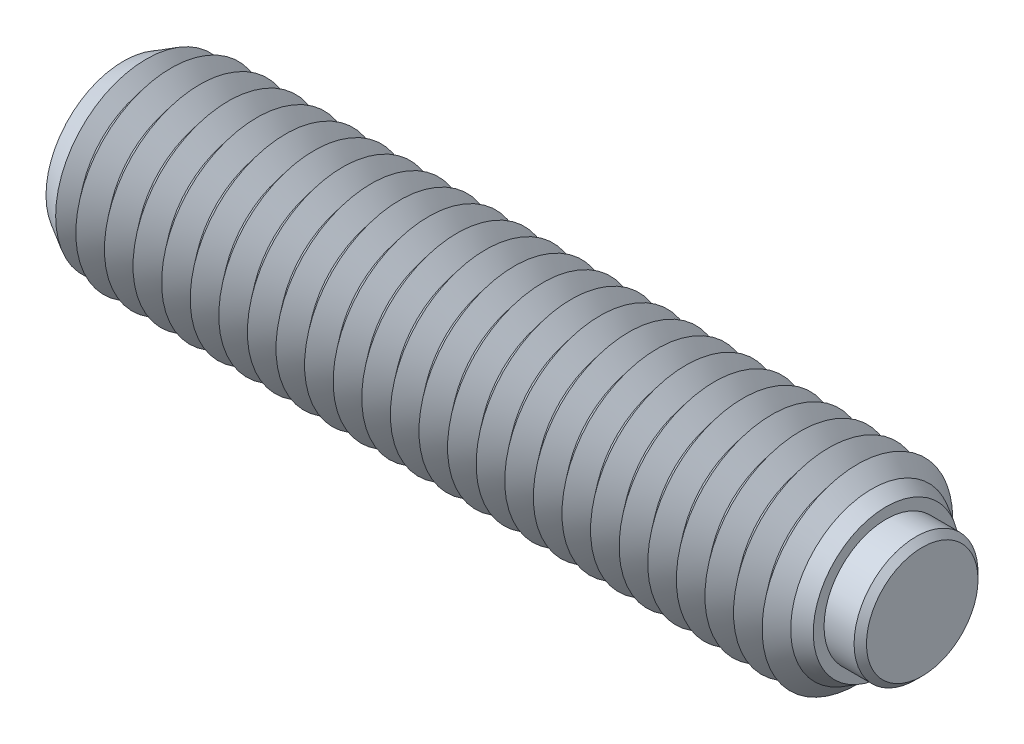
ISO-10303-21;
HEADER;
FILE_DESCRIPTION(('STEP AP214'),'2;1');
FILE_NAME('part.step','',(''),(''),'','','');
FILE_SCHEMA(('AUTOMOTIVE_DESIGN { 1 0 10303 214 1 1 1 1 }'));
ENDSEC;
DATA;
#1=APPLICATION_CONTEXT('core data for automotive mechanical design processes');
#2=APPLICATION_PROTOCOL_DEFINITION('international standard','automotive_design',2000,#1);
#3=PRODUCT_CONTEXT('',#1,'mechanical');
#4=PRODUCT('Part','Part','',(#3));
#5=PRODUCT_RELATED_PRODUCT_CATEGORY('part','',(#4));
#6=PRODUCT_DEFINITION_FORMATION('','',#4);
#7=PRODUCT_DEFINITION_CONTEXT('part definition',#1,'design');
#8=PRODUCT_DEFINITION('design','',#6,#7);
#9=PRODUCT_DEFINITION_SHAPE('','',#8);
#10=(LENGTH_UNIT() NAMED_UNIT(*) SI_UNIT(.MILLI.,.METRE.));
#11=(NAMED_UNIT(*) PLANE_ANGLE_UNIT() SI_UNIT($,.RADIAN.));
#12=(NAMED_UNIT(*) SI_UNIT($,.STERADIAN.) SOLID_ANGLE_UNIT());
#13=UNCERTAINTY_MEASURE_WITH_UNIT(LENGTH_MEASURE(1.E-05),#10,'distance_accuracy_value','');
#14=(GEOMETRIC_REPRESENTATION_CONTEXT(3) GLOBAL_UNCERTAINTY_ASSIGNED_CONTEXT((#13)) GLOBAL_UNIT_ASSIGNED_CONTEXT((#10,
#11,#12)) REPRESENTATION_CONTEXT('',''));
#15=CARTESIAN_POINT('',(0.,0.,0.));
#16=DIRECTION('',(0.,0.,1.));
#17=DIRECTION('',(1.,0.,0.));
#18=AXIS2_PLACEMENT_3D('',#15,#16,#17);
#19=CARTESIAN_POINT('',(2.65,0.,0.));
#20=DIRECTION('',(-1.,0.,0.));
#21=DIRECTION('',(0.,0.,1.));
#22=AXIS2_PLACEMENT_3D('',#19,#20,#21);
#23=CYLINDRICAL_SURFACE('',#22,3.25);
#24=CARTESIAN_POINT('',(2.325,0.,0.));
#25=DIRECTION('',(1.,0.,0.));
#26=DIRECTION('',(0.,0.,-1.));
#27=AXIS2_PLACEMENT_3D('',#24,#25,#26);
#28=CIRCLE('',#27,3.25);
#29=CARTESIAN_POINT('',(2.325,0.,3.25));
#30=VERTEX_POINT('',#29);
#31=EDGE_CURVE('P0_E10',#30,#30,#28,.F.);
#32=CARTESIAN_POINT('',(-1.15,0.,0.));
#33=DIRECTION('',(1.,0.,0.));
#34=DIRECTION('',(0.,0.,-1.));
#35=AXIS2_PLACEMENT_3D('',#32,#33,#34);
#36=CIRCLE('',#35,3.25);
#37=CARTESIAN_POINT('',(-1.15,0.,3.25));
#38=VERTEX_POINT('',#37);
#39=EDGE_CURVE('P0_E25',#38,#38,#36,.T.);
#40=CARTESIAN_POINT('',(2.325,0.,3.25));
#41=CARTESIAN_POINT('',(2.28880208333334,0.,3.25));
#42=CARTESIAN_POINT('',(2.25260416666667,0.,3.25));
#43=CARTESIAN_POINT('',(2.18020833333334,0.,3.25));
#44=CARTESIAN_POINT('',(2.14401041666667,0.,3.25));
#45=CARTESIAN_POINT('',(2.07161458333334,0.,3.25));
#46=CARTESIAN_POINT('',(2.03541666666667,0.,3.25));
#47=CARTESIAN_POINT('',(1.96302083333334,0.,3.25));
#48=CARTESIAN_POINT('',(1.92682291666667,0.,3.25));
#49=CARTESIAN_POINT('',(1.85442708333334,0.,3.25));
#50=CARTESIAN_POINT('',(1.81822916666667,0.,3.25));
#51=CARTESIAN_POINT('',(1.74583333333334,0.,3.25));
#52=CARTESIAN_POINT('',(1.70963541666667,0.,3.25));
#53=CARTESIAN_POINT('',(1.63723958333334,0.,3.25));
#54=CARTESIAN_POINT('',(1.60104166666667,0.,3.25));
#55=CARTESIAN_POINT('',(1.52864583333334,0.,3.25));
#56=CARTESIAN_POINT('',(1.49244791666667,0.,3.25));
#57=CARTESIAN_POINT('',(1.42005208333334,0.,3.25));
#58=CARTESIAN_POINT('',(1.38385416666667,0.,3.25));
#59=CARTESIAN_POINT('',(1.31145833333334,0.,3.25));
#60=CARTESIAN_POINT('',(1.27526041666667,0.,3.25));
#61=CARTESIAN_POINT('',(1.20286458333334,0.,3.25));
#62=CARTESIAN_POINT('',(1.16666666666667,0.,3.25));
#63=CARTESIAN_POINT('',(1.09427083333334,0.,3.25));
#64=CARTESIAN_POINT('',(1.05807291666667,0.,3.25));
#65=CARTESIAN_POINT('',(0.985677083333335,0.,3.25));
#66=CARTESIAN_POINT('',(0.949479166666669,0.,3.25));
#67=CARTESIAN_POINT('',(0.877083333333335,0.,3.25));
#68=CARTESIAN_POINT('',(0.840885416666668,0.,3.25));
#69=CARTESIAN_POINT('',(0.768489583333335,0.,3.25));
#70=CARTESIAN_POINT('',(0.732291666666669,0.,3.25));
#71=CARTESIAN_POINT('',(0.659895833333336,0.,3.25));
#72=CARTESIAN_POINT('',(0.623697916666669,0.,3.25));
#73=CARTESIAN_POINT('',(0.551302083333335,0.,3.25));
#74=CARTESIAN_POINT('',(0.515104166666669,0.,3.25));
#75=CARTESIAN_POINT('',(0.442708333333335,0.,3.25));
#76=CARTESIAN_POINT('',(0.406510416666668,0.,3.25));
#77=CARTESIAN_POINT('',(0.334114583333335,0.,3.25));
#78=CARTESIAN_POINT('',(0.297916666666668,0.,3.25));
#79=CARTESIAN_POINT('',(0.225520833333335,0.,3.25));
#80=CARTESIAN_POINT('',(0.189322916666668,0.,3.25));
#81=CARTESIAN_POINT('',(0.116927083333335,0.,3.25));
#82=CARTESIAN_POINT('',(0.0807291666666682,0.,3.25));
#83=CARTESIAN_POINT('',(0.00833333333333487,0.,3.25));
#84=CARTESIAN_POINT('',(-0.0278645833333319,0.,3.25));
#85=CARTESIAN_POINT('',(-0.100260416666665,0.,3.25));
#86=CARTESIAN_POINT('',(-0.136458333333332,0.,3.25));
#87=CARTESIAN_POINT('',(-0.208854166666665,0.,3.25));
#88=CARTESIAN_POINT('',(-0.245052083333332,0.,3.25));
#89=CARTESIAN_POINT('',(-0.317447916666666,0.,3.25));
#90=CARTESIAN_POINT('',(-0.353645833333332,0.,3.25));
#91=CARTESIAN_POINT('',(-0.426041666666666,0.,3.25));
#92=CARTESIAN_POINT('',(-0.462239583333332,0.,3.25));
#93=CARTESIAN_POINT('',(-0.534635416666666,0.,3.25));
#94=CARTESIAN_POINT('',(-0.570833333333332,0.,3.25));
#95=CARTESIAN_POINT('',(-0.643229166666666,0.,3.25));
#96=CARTESIAN_POINT('',(-0.679427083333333,0.,3.25));
#97=CARTESIAN_POINT('',(-0.751822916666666,0.,3.25));
#98=CARTESIAN_POINT('',(-0.788020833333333,0.,3.25));
#99=CARTESIAN_POINT('',(-0.860416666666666,0.,3.25));
#100=CARTESIAN_POINT('',(-0.896614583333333,0.,3.25));
#101=CARTESIAN_POINT('',(-0.969010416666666,0.,3.25));
#102=CARTESIAN_POINT('',(-1.00520833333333,0.,3.25));
#103=CARTESIAN_POINT('',(-1.07760416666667,0.,3.25));
#104=CARTESIAN_POINT('',(-1.11380208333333,0.,3.25));
#105=CARTESIAN_POINT('',(-1.15,0.,3.25));
#106=B_SPLINE_CURVE_WITH_KNOTS('',3,(#40,#41,#42,#43,#44,#45,#46,#47,#48,#49,#50,#51,#52,#53,
#54,#55,#56,#57,#58,#59,#60,#61,#62,#63,#64,#65,#66,#67,#68,#69,#70,#71,#72,#73,#74,#75,#76,#77,
#78,#79,#80,#81,#82,#83,#84,#85,#86,#87,#88,#89,#90,#91,#92,#93,#94,#95,#96,#97,#98,#99,#100,
#101,#102,#103,#104,#105),.UNSPECIFIED.,.F.,.F.,(4,2,2,2,2,2,2,2,2,2,2,2,2,2,2,2,2,2,2,2,2,2,2,
2,2,2,2,2,2,2,2,2,4),(0.,0.10859375,0.2171875,0.32578125,0.434375,0.54296875,0.6515625,
0.76015625,0.86875,0.977343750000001,1.0859375,1.19453125,1.303125,1.41171875,1.5203125,
1.62890625,1.7375,1.84609375,1.9546875,2.06328125,2.171875,2.28046875,2.3890625,2.49765625,
2.60625,2.71484375,2.8234375,2.93203125,3.040625,3.14921875,3.2578125,3.36640625,3.475),.UNSPECIFIED.);
#107=EDGE_CURVE('P0_BSEAM14',#30,#38,#106,.T.);
#108=ORIENTED_EDGE('',*,*,#31,.T.);
#109=ORIENTED_EDGE('',*,*,#39,.T.);
#110=ORIENTED_EDGE('',*,*,#107,.T.);
#111=ORIENTED_EDGE('',*,*,#107,.F.);
#112=EDGE_LOOP('',(#108,#110,#109,#111));
#113=FACE_BOUND('',#112,.T.);
#114=ADVANCED_FACE('P0_F14',(#113),#23,.T.);
#115=CARTESIAN_POINT('',(2.65,0.,0.));
#116=DIRECTION('',(1.,0.,0.));
#117=DIRECTION('',(0.,0.,-1.));
#118=AXIS2_PLACEMENT_3D('',#115,#116,#117);
#119=PLANE('',#118);
#120=CARTESIAN_POINT('',(2.65,0.,0.));
#121=DIRECTION('',(1.,0.,0.));
#122=DIRECTION('',(0.,0.,-1.));
#123=AXIS2_PLACEMENT_3D('',#120,#121,#122);
#124=CIRCLE('',#123,2.92500000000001);
#125=CARTESIAN_POINT('',(2.65,0.,-2.92500000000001));
#126=VERTEX_POINT('',#125);
#127=EDGE_CURVE('P0_E21',#126,#126,#124,.T.);
#128=ORIENTED_EDGE('',*,*,#127,.T.);
#129=EDGE_LOOP('',(#128));
#130=FACE_BOUND('',#129,.T.);
#131=ADVANCED_FACE('P0_F35',(#130),#119,.T.);
#132=CARTESIAN_POINT('',(-1.15,0.,0.));
#133=DIRECTION('',(1.,0.,0.));
#134=DIRECTION('',(0.,0.,-1.));
#135=AXIS2_PLACEMENT_3D('',#132,#133,#134);
#136=PLANE('',#135);
#137=ORIENTED_EDGE('',*,*,#39,.F.);
#138=EDGE_LOOP('',(#137));
#139=FACE_BOUND('',#138,.T.);
#140=ADVANCED_FACE('P0_F33',(#139),#136,.F.);
#141=CARTESIAN_POINT('',(2.65,0.,0.));
#142=DIRECTION('',(-1.,0.,0.));
#143=DIRECTION('',(0.,0.,1.));
#144=AXIS2_PLACEMENT_3D('',#141,#142,#143);
#145=CONICAL_SURFACE('',#144,2.92500000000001,0.785398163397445);
#146=ORIENTED_EDGE('',*,*,#31,.F.);
#147=EDGE_LOOP('',(#146));
#148=FACE_BOUND('',#147,.T.);
#149=ORIENTED_EDGE('',*,*,#127,.F.);
#150=EDGE_LOOP('',(#149));
#151=FACE_BOUND('',#150,.T.);
#152=ADVANCED_FACE('P0_F16',(#148,#151),#145,.T.);
#153=CLOSED_SHELL('',(#114,#131,#140,#152));
#154=MANIFOLD_SOLID_BREP('P0_B1',#153);
#155=CARTESIAN_POINT('',(-38.25,0.,0.));
#156=DIRECTION('',(-1.,0.,0.));
#157=DIRECTION('',(0.,0.,1.));
#158=AXIS2_PLACEMENT_3D('',#155,#156,#157);
#159=CONICAL_SURFACE('',#158,5.,0.895664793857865);
#160=CARTESIAN_POINT('',(-37.5,0.,0.));
#161=DIRECTION('',(1.,0.,0.));
#162=DIRECTION('',(0.,0.,-1.));
#163=AXIS2_PLACEMENT_3D('',#160,#161,#162);
#164=CIRCLE('',#163,4.06325030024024);
#165=CARTESIAN_POINT('',(-37.5,0.,-4.06325030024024));
#166=VERTEX_POINT('',#165);
#167=EDGE_CURVE('P1_E1139',#166,#166,#164,.T.);
#168=ORIENTED_EDGE('',*,*,#167,.F.);
#169=EDGE_LOOP('',(#168));
#170=FACE_BOUND('',#169,.T.);
#171=CARTESIAN_POINT('',(-38.0532143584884,0.,0.));
#172=DIRECTION('',(1.,0.,0.));
#173=DIRECTION('',(0.,0.,-1.));
#174=AXIS2_PLACEMENT_3D('',#171,#172,#173);
#175=CIRCLE('',#174,4.75421481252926);
#176=CARTESIAN_POINT('',(-38.0532143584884,0.,-4.75421481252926));
#177=VERTEX_POINT('',#176);
#178=EDGE_CURVE('P1_E1142',#177,#177,#175,.F.);
#179=ORIENTED_EDGE('',*,*,#178,.F.);
#180=EDGE_LOOP('',(#179));
#181=FACE_BOUND('',#180,.T.);
#182=ADVANCED_FACE('P1_F15',(#170,#181),#159,.T.);
#183=CARTESIAN_POINT('',(-1.5,0.,0.));
#184=DIRECTION('',(1.,0.,0.));
#185=DIRECTION('',(0.,0.,-1.));
#186=AXIS2_PLACEMENT_3D('',#183,#184,#185);
#187=CONICAL_SURFACE('',#186,4.06325030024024,0.895664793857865);
#188=CARTESIAN_POINT('',(-0.750000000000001,0.,0.));
#189=DIRECTION('',(1.,0.,0.));
#190=DIRECTION('',(0.,0.,-1.));
#191=AXIS2_PLACEMENT_3D('',#188,#189,#190);
#192=CIRCLE('',#191,5.);
#193=CARTESIAN_POINT('',(-0.750000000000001,0.,-5.));
#194=VERTEX_POINT('',#193);
#195=EDGE_CURVE('P1_E991',#194,#194,#192,.T.);
#196=ORIENTED_EDGE('',*,*,#195,.F.);
#197=EDGE_LOOP('',(#196));
#198=FACE_BOUND('',#197,.T.);
#199=CARTESIAN_POINT('',(-1.5,0.,0.));
#200=DIRECTION('',(1.,0.,0.));
#201=DIRECTION('',(0.,0.,-1.));
#202=AXIS2_PLACEMENT_3D('',#199,#200,#201);
#203=CIRCLE('',#202,4.06325030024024);
#204=CARTESIAN_POINT('',(-1.5,0.,-4.06325030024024));
#205=VERTEX_POINT('',#204);
#206=EDGE_CURVE('P1_E992',#205,#205,#203,.T.);
#207=ORIENTED_EDGE('',*,*,#206,.T.);
#208=EDGE_LOOP('',(#207));
#209=FACE_BOUND('',#208,.T.);
#210=ADVANCED_FACE('P1_F222',(#198,#209),#187,.T.);
#211=CARTESIAN_POINT('',(-2.25,0.,0.));
#212=DIRECTION('',(-1.,0.,0.));
#213=DIRECTION('',(0.,0.,1.));
#214=AXIS2_PLACEMENT_3D('',#211,#212,#213);
#215=CONICAL_SURFACE('',#214,5.,0.895664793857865);
#216=ORIENTED_EDGE('',*,*,#206,.F.);
#217=EDGE_LOOP('',(#216));
#218=FACE_BOUND('',#217,.T.);
#219=CARTESIAN_POINT('',(-2.25,0.,0.));
#220=DIRECTION('',(1.,0.,0.));
#221=DIRECTION('',(0.,0.,-1.));
#222=AXIS2_PLACEMENT_3D('',#219,#220,#221);
#223=CIRCLE('',#222,5.);
#224=CARTESIAN_POINT('',(-2.25,0.,-5.));
#225=VERTEX_POINT('',#224);
#226=EDGE_CURVE('P1_E996',#225,#225,#223,.T.);
#227=ORIENTED_EDGE('',*,*,#226,.T.);
#228=EDGE_LOOP('',(#227));
#229=FACE_BOUND('',#228,.T.);
#230=ADVANCED_FACE('P1_F227',(#218,#229),#215,.T.);
#231=CARTESIAN_POINT('',(-1.15,0.,0.));
#232=DIRECTION('',(1.,0.,0.));
#233=DIRECTION('',(0.,1.,0.));
#234=AXIS2_PLACEMENT_3D('',#231,#232,#233);
#235=PLANE('',#234);
#236=CARTESIAN_POINT('',(-1.15,0.,0.));
#237=DIRECTION('',(1.,0.,0.));
#238=DIRECTION('',(0.,1.,0.));
#239=AXIS2_PLACEMENT_3D('',#236,#237,#238);
#240=CIRCLE('',#239,3.25);
#241=CARTESIAN_POINT('',(-1.15,3.25,0.));
#242=VERTEX_POINT('',#241);
#243=EDGE_CURVE('P1_E494',#242,#242,#240,.T.);
#244=ORIENTED_EDGE('',*,*,#243,.T.);
#245=EDGE_LOOP('',(#244));
#246=FACE_BOUND('',#245,.T.);
#247=ADVANCED_FACE('P1_F421',(#246),#235,.T.);
#248=CARTESIAN_POINT('',(-1.15,0.,0.));
#249=DIRECTION('',(1.,0.,0.));
#250=DIRECTION('',(0.,1.,0.));
#251=AXIS2_PLACEMENT_3D('',#248,#249,#250);
#252=CYLINDRICAL_SURFACE('',#251,3.25);
#253=CARTESIAN_POINT('',(0.75,0.,0.));
#254=DIRECTION('',(1.,0.,0.));
#255=DIRECTION('',(0.,1.,0.));
#256=AXIS2_PLACEMENT_3D('',#253,#254,#255);
#257=CIRCLE('',#256,3.25);
#258=CARTESIAN_POINT('',(0.75,3.25,0.));
#259=VERTEX_POINT('',#258);
#260=EDGE_CURVE('P1_E497',#259,#259,#257,.T.);
#261=CARTESIAN_POINT('',(-1.15,3.25,0.));
#262=CARTESIAN_POINT('',(-1.13020833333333,3.25,0.));
#263=CARTESIAN_POINT('',(-1.11041666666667,3.25,0.));
#264=CARTESIAN_POINT('',(-1.07083333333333,3.25,0.));
#265=CARTESIAN_POINT('',(-1.05104166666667,3.25,0.));
#266=CARTESIAN_POINT('',(-1.01145833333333,3.25,0.));
#267=CARTESIAN_POINT('',(-0.991666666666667,3.25,0.));
#268=CARTESIAN_POINT('',(-0.952083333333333,3.25,0.));
#269=CARTESIAN_POINT('',(-0.932291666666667,3.25,0.));
#270=CARTESIAN_POINT('',(-0.892708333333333,3.25,0.));
#271=CARTESIAN_POINT('',(-0.872916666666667,3.25,0.));
#272=CARTESIAN_POINT('',(-0.833333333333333,3.25,0.));
#273=CARTESIAN_POINT('',(-0.813541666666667,3.25,0.));
#274=CARTESIAN_POINT('',(-0.773958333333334,3.25,0.));
#275=CARTESIAN_POINT('',(-0.754166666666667,3.25,0.));
#276=CARTESIAN_POINT('',(-0.714583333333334,3.25,0.));
#277=CARTESIAN_POINT('',(-0.694791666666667,3.25,0.));
#278=CARTESIAN_POINT('',(-0.655208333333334,3.25,0.));
#279=CARTESIAN_POINT('',(-0.635416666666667,3.25,0.));
#280=CARTESIAN_POINT('',(-0.595833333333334,3.25,0.));
#281=CARTESIAN_POINT('',(-0.576041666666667,3.25,0.));
#282=CARTESIAN_POINT('',(-0.536458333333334,3.25,0.));
#283=CARTESIAN_POINT('',(-0.516666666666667,3.25,0.));
#284=CARTESIAN_POINT('',(-0.477083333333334,3.25,0.));
#285=CARTESIAN_POINT('',(-0.457291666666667,3.25,0.));
#286=CARTESIAN_POINT('',(-0.417708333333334,3.25,0.));
#287=CARTESIAN_POINT('',(-0.397916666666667,3.25,0.));
#288=CARTESIAN_POINT('',(-0.358333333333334,3.25,0.));
#289=CARTESIAN_POINT('',(-0.338541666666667,3.25,0.));
#290=CARTESIAN_POINT('',(-0.298958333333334,3.25,0.));
#291=CARTESIAN_POINT('',(-0.279166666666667,3.25,0.));
#292=CARTESIAN_POINT('',(-0.239583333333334,3.25,0.));
#293=CARTESIAN_POINT('',(-0.219791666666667,3.25,0.));
#294=CARTESIAN_POINT('',(-0.180208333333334,3.25,0.));
#295=CARTESIAN_POINT('',(-0.160416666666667,3.25,0.));
#296=CARTESIAN_POINT('',(-0.120833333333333,3.25,0.));
#297=CARTESIAN_POINT('',(-0.101041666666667,3.25,0.));
#298=CARTESIAN_POINT('',(-0.0614583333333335,3.25,0.));
#299=CARTESIAN_POINT('',(-0.0416666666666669,3.25,0.));
#300=CARTESIAN_POINT('',(-0.00208333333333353,3.25,0.));
#301=CARTESIAN_POINT('',(0.0177083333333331,3.25,0.));
#302=CARTESIAN_POINT('',(0.0572916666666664,3.25,0.));
#303=CARTESIAN_POINT('',(0.0770833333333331,3.25,0.));
#304=CARTESIAN_POINT('',(0.116666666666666,3.25,0.));
#305=CARTESIAN_POINT('',(0.136458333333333,3.25,0.));
#306=CARTESIAN_POINT('',(0.176041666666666,3.25,0.));
#307=CARTESIAN_POINT('',(0.195833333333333,3.25,0.));
#308=CARTESIAN_POINT('',(0.235416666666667,3.25,0.));
#309=CARTESIAN_POINT('',(0.255208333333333,3.25,0.));
#310=CARTESIAN_POINT('',(0.294791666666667,3.25,0.));
#311=CARTESIAN_POINT('',(0.314583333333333,3.25,0.));
#312=CARTESIAN_POINT('',(0.354166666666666,3.25,0.));
#313=CARTESIAN_POINT('',(0.373958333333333,3.25,0.));
#314=CARTESIAN_POINT('',(0.413541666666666,3.25,0.));
#315=CARTESIAN_POINT('',(0.433333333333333,3.25,0.));
#316=CARTESIAN_POINT('',(0.472916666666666,3.25,0.));
#317=CARTESIAN_POINT('',(0.492708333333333,3.25,0.));
#318=CARTESIAN_POINT('',(0.532291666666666,3.25,0.));
#319=CARTESIAN_POINT('',(0.552083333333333,3.25,0.));
#320=CARTESIAN_POINT('',(0.591666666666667,3.25,0.));
#321=CARTESIAN_POINT('',(0.611458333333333,3.25,0.));
#322=CARTESIAN_POINT('',(0.651041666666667,3.25,0.));
#323=CARTESIAN_POINT('',(0.670833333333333,3.25,0.));
#324=CARTESIAN_POINT('',(0.710416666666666,3.25,0.));
#325=CARTESIAN_POINT('',(0.730208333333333,3.25,0.));
#326=CARTESIAN_POINT('',(0.75,3.25,0.));
#327=B_SPLINE_CURVE_WITH_KNOTS('',3,(#261,#262,#263,#264,#265,#266,#267,#268,#269,#270,#271,
#272,#273,#274,#275,#276,#277,#278,#279,#280,#281,#282,#283,#284,#285,#286,#287,#288,#289,#290,
#291,#292,#293,#294,#295,#296,#297,#298,#299,#300,#301,#302,#303,#304,#305,#306,#307,#308,#309,
#310,#311,#312,#313,#314,#315,#316,#317,#318,#319,#320,#321,#322,#323,#324,#325,#326),
.UNSPECIFIED.,.F.,.F.,(4,2,2,2,2,2,2,2,2,2,2,2,2,2,2,2,2,2,2,2,2,2,2,2,2,2,2,2,2,2,2,2,4),(0.,
0.059375,0.11875,0.178125,0.2375,0.296875,0.35625,0.415625,0.475,0.534375,0.59375,0.653125,
0.7125,0.771875,0.83125,0.890625,0.95,1.009375,1.06875,1.128125,1.1875,1.246875,1.30625,
1.365625,1.425,1.484375,1.54375,1.603125,1.6625,1.721875,1.78125,1.840625,1.9),.UNSPECIFIED.);
#328=EDGE_CURVE('P1_BSEAM209',#242,#259,#327,.T.);
#329=ORIENTED_EDGE('',*,*,#243,.F.);
#330=ORIENTED_EDGE('',*,*,#260,.T.);
#331=ORIENTED_EDGE('',*,*,#328,.T.);
#332=ORIENTED_EDGE('',*,*,#328,.F.);
#333=EDGE_LOOP('',(#329,#331,#330,#332));
#334=FACE_BOUND('',#333,.T.);
#335=ADVANCED_FACE('P1_F209',(#334),#252,.F.);
#336=CARTESIAN_POINT('',(0.75,3.81698729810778,0.));
#337=DIRECTION('',(1.,0.,0.));
#338=DIRECTION('',(0.,1.,0.));
#339=AXIS2_PLACEMENT_3D('',#336,#337,#338);
#340=PLANE('',#339);
#341=ORIENTED_EDGE('',*,*,#260,.F.);
#342=EDGE_LOOP('',(#341));
#343=FACE_BOUND('',#342,.T.);
#344=CARTESIAN_POINT('',(0.75,0.,0.));
#345=DIRECTION('',(1.,0.,0.));
#346=DIRECTION('',(0.,1.,0.));
#347=AXIS2_PLACEMENT_3D('',#344,#345,#346);
#348=CIRCLE('',#347,3.81698729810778);
#349=CARTESIAN_POINT('',(0.75,3.81698729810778,0.));
#350=VERTEX_POINT('',#349);
#351=EDGE_CURVE('P1_E121',#350,#350,#348,.T.);
#352=ORIENTED_EDGE('',*,*,#351,.T.);
#353=EDGE_LOOP('',(#352));
#354=FACE_BOUND('',#353,.T.);
#355=ADVANCED_FACE('P1_F206',(#343,#354),#340,.T.);
#356=CARTESIAN_POINT('',(0.75,0.,0.));
#357=DIRECTION('',(-1.,0.,0.));
#358=DIRECTION('',(0.,-1.,0.));
#359=AXIS2_PLACEMENT_3D('',#356,#357,#358);
#360=CONICAL_SURFACE('',#359,3.81698729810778,0.523598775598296);
#361=CARTESIAN_POINT('',(0.,0.,0.));
#362=DIRECTION('',(1.,0.,0.));
#363=DIRECTION('',(0.,0.,-1.));
#364=AXIS2_PLACEMENT_3D('',#361,#362,#363);
#365=CIRCLE('',#364,4.25);
#366=CARTESIAN_POINT('',(0.,0.,-4.25));
#367=VERTEX_POINT('',#366);
#368=EDGE_CURVE('P1_E485',#367,#367,#365,.T.);
#369=ORIENTED_EDGE('',*,*,#368,.T.);
#370=EDGE_LOOP('',(#369));
#371=FACE_BOUND('',#370,.T.);
#372=ORIENTED_EDGE('',*,*,#351,.F.);
#373=EDGE_LOOP('',(#372));
#374=FACE_BOUND('',#373,.T.);
#375=ADVANCED_FACE('P1_F203',(#371,#374),#360,.T.);
#376=CARTESIAN_POINT('',(0.,0.,0.));
#377=DIRECTION('',(-1.,0.,0.));
#378=DIRECTION('',(0.,0.,1.));
#379=AXIS2_PLACEMENT_3D('',#376,#377,#378);
#380=CONICAL_SURFACE('',#379,4.25,0.785398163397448);
#381=ORIENTED_EDGE('',*,*,#195,.T.);
#382=EDGE_LOOP('',(#381));
#383=FACE_BOUND('',#382,.T.);
#384=ORIENTED_EDGE('',*,*,#368,.F.);
#385=EDGE_LOOP('',(#384));
#386=FACE_BOUND('',#385,.T.);
#387=ADVANCED_FACE('P1_F17',(#383,#386),#380,.T.);
#388=CARTESIAN_POINT('',(-3.,0.,0.));
#389=DIRECTION('',(1.,0.,0.));
#390=DIRECTION('',(0.,0.,-1.));
#391=AXIS2_PLACEMENT_3D('',#388,#389,#390);
#392=CONICAL_SURFACE('',#391,4.06325030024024,0.895664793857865);
#393=ORIENTED_EDGE('',*,*,#226,.F.);
#394=EDGE_LOOP('',(#393));
#395=FACE_BOUND('',#394,.T.);
#396=CARTESIAN_POINT('',(-3.,0.,0.));
#397=DIRECTION('',(1.,0.,0.));
#398=DIRECTION('',(0.,0.,-1.));
#399=AXIS2_PLACEMENT_3D('',#396,#397,#398);
#400=CIRCLE('',#399,4.06325030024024);
#401=CARTESIAN_POINT('',(-3.,0.,-4.06325030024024));
#402=VERTEX_POINT('',#401);
#403=EDGE_CURVE('P1_E1001',#402,#402,#400,.T.);
#404=ORIENTED_EDGE('',*,*,#403,.T.);
#405=EDGE_LOOP('',(#404));
#406=FACE_BOUND('',#405,.T.);
#407=ADVANCED_FACE('P1_F415',(#395,#406),#392,.T.);
#408=CARTESIAN_POINT('',(-3.75,0.,0.));
#409=DIRECTION('',(-1.,0.,0.));
#410=DIRECTION('',(0.,0.,1.));
#411=AXIS2_PLACEMENT_3D('',#408,#409,#410);
#412=CONICAL_SURFACE('',#411,5.,0.895664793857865);
#413=ORIENTED_EDGE('',*,*,#403,.F.);
#414=EDGE_LOOP('',(#413));
#415=FACE_BOUND('',#414,.T.);
#416=CARTESIAN_POINT('',(-3.75,0.,0.));
#417=DIRECTION('',(1.,0.,0.));
#418=DIRECTION('',(0.,0.,-1.));
#419=AXIS2_PLACEMENT_3D('',#416,#417,#418);
#420=CIRCLE('',#419,5.);
#421=CARTESIAN_POINT('',(-3.75,0.,-5.));
#422=VERTEX_POINT('',#421);
#423=EDGE_CURVE('P1_E1004',#422,#422,#420,.T.);
#424=ORIENTED_EDGE('',*,*,#423,.T.);
#425=EDGE_LOOP('',(#424));
#426=FACE_BOUND('',#425,.T.);
#427=ADVANCED_FACE('P1_F411',(#415,#426),#412,.T.);
#428=CARTESIAN_POINT('',(-4.5,0.,0.));
#429=DIRECTION('',(1.,0.,0.));
#430=DIRECTION('',(0.,0.,-1.));
#431=AXIS2_PLACEMENT_3D('',#428,#429,#430);
#432=CONICAL_SURFACE('',#431,4.06325030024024,0.895664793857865);
#433=ORIENTED_EDGE('',*,*,#423,.F.);
#434=EDGE_LOOP('',(#433));
#435=FACE_BOUND('',#434,.T.);
#436=CARTESIAN_POINT('',(-4.5,0.,0.));
#437=DIRECTION('',(1.,0.,0.));
#438=DIRECTION('',(0.,0.,-1.));
#439=AXIS2_PLACEMENT_3D('',#436,#437,#438);
#440=CIRCLE('',#439,4.06325030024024);
#441=CARTESIAN_POINT('',(-4.5,0.,-4.06325030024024));
#442=VERTEX_POINT('',#441);
#443=EDGE_CURVE('P1_E1007',#442,#442,#440,.T.);
#444=ORIENTED_EDGE('',*,*,#443,.T.);
#445=EDGE_LOOP('',(#444));
#446=FACE_BOUND('',#445,.T.);
#447=ADVANCED_FACE('P1_F407',(#435,#446),#432,.T.);
#448=CARTESIAN_POINT('',(-5.25,0.,0.));
#449=DIRECTION('',(-1.,0.,0.));
#450=DIRECTION('',(0.,0.,1.));
#451=AXIS2_PLACEMENT_3D('',#448,#449,#450);
#452=CONICAL_SURFACE('',#451,5.,0.895664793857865);
#453=ORIENTED_EDGE('',*,*,#443,.F.);
#454=EDGE_LOOP('',(#453));
#455=FACE_BOUND('',#454,.T.);
#456=CARTESIAN_POINT('',(-5.25,0.,0.));
#457=DIRECTION('',(1.,0.,0.));
#458=DIRECTION('',(0.,0.,-1.));
#459=AXIS2_PLACEMENT_3D('',#456,#457,#458);
#460=CIRCLE('',#459,5.);
#461=CARTESIAN_POINT('',(-5.25,0.,-5.));
#462=VERTEX_POINT('',#461);
#463=EDGE_CURVE('P1_E1010',#462,#462,#460,.T.);
#464=ORIENTED_EDGE('',*,*,#463,.T.);
#465=EDGE_LOOP('',(#464));
#466=FACE_BOUND('',#465,.T.);
#467=ADVANCED_FACE('P1_F403',(#455,#466),#452,.T.);
#468=CARTESIAN_POINT('',(-6.,0.,0.));
#469=DIRECTION('',(1.,0.,0.));
#470=DIRECTION('',(0.,0.,-1.));
#471=AXIS2_PLACEMENT_3D('',#468,#469,#470);
#472=CONICAL_SURFACE('',#471,4.06325030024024,0.895664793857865);
#473=ORIENTED_EDGE('',*,*,#463,.F.);
#474=EDGE_LOOP('',(#473));
#475=FACE_BOUND('',#474,.T.);
#476=CARTESIAN_POINT('',(-6.,0.,0.));
#477=DIRECTION('',(1.,0.,0.));
#478=DIRECTION('',(0.,0.,-1.));
#479=AXIS2_PLACEMENT_3D('',#476,#477,#478);
#480=CIRCLE('',#479,4.06325030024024);
#481=CARTESIAN_POINT('',(-6.,0.,-4.06325030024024));
#482=VERTEX_POINT('',#481);
#483=EDGE_CURVE('P1_E1013',#482,#482,#480,.T.);
#484=ORIENTED_EDGE('',*,*,#483,.T.);
#485=EDGE_LOOP('',(#484));
#486=FACE_BOUND('',#485,.T.);
#487=ADVANCED_FACE('P1_F399',(#475,#486),#472,.T.);
#488=CARTESIAN_POINT('',(-6.75,0.,0.));
#489=DIRECTION('',(-1.,0.,0.));
#490=DIRECTION('',(0.,0.,1.));
#491=AXIS2_PLACEMENT_3D('',#488,#489,#490);
#492=CONICAL_SURFACE('',#491,5.,0.895664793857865);
#493=ORIENTED_EDGE('',*,*,#483,.F.);
#494=EDGE_LOOP('',(#493));
#495=FACE_BOUND('',#494,.T.);
#496=CARTESIAN_POINT('',(-6.75,0.,0.));
#497=DIRECTION('',(1.,0.,0.));
#498=DIRECTION('',(0.,0.,-1.));
#499=AXIS2_PLACEMENT_3D('',#496,#497,#498);
#500=CIRCLE('',#499,5.);
#501=CARTESIAN_POINT('',(-6.75,0.,-5.));
#502=VERTEX_POINT('',#501);
#503=EDGE_CURVE('P1_E1016',#502,#502,#500,.T.);
#504=ORIENTED_EDGE('',*,*,#503,.T.);
#505=EDGE_LOOP('',(#504));
#506=FACE_BOUND('',#505,.T.);
#507=ADVANCED_FACE('P1_F395',(#495,#506),#492,.T.);
#508=CARTESIAN_POINT('',(-7.5,0.,0.));
#509=DIRECTION('',(1.,0.,0.));
#510=DIRECTION('',(0.,0.,-1.));
#511=AXIS2_PLACEMENT_3D('',#508,#509,#510);
#512=CONICAL_SURFACE('',#511,4.06325030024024,0.895664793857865);
#513=ORIENTED_EDGE('',*,*,#503,.F.);
#514=EDGE_LOOP('',(#513));
#515=FACE_BOUND('',#514,.T.);
#516=CARTESIAN_POINT('',(-7.5,0.,0.));
#517=DIRECTION('',(1.,0.,0.));
#518=DIRECTION('',(0.,0.,-1.));
#519=AXIS2_PLACEMENT_3D('',#516,#517,#518);
#520=CIRCLE('',#519,4.06325030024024);
#521=CARTESIAN_POINT('',(-7.5,0.,-4.06325030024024));
#522=VERTEX_POINT('',#521);
#523=EDGE_CURVE('P1_E1019',#522,#522,#520,.T.);
#524=ORIENTED_EDGE('',*,*,#523,.T.);
#525=EDGE_LOOP('',(#524));
#526=FACE_BOUND('',#525,.T.);
#527=ADVANCED_FACE('P1_F391',(#515,#526),#512,.T.);
#528=CARTESIAN_POINT('',(-8.25,0.,0.));
#529=DIRECTION('',(-1.,0.,0.));
#530=DIRECTION('',(0.,0.,1.));
#531=AXIS2_PLACEMENT_3D('',#528,#529,#530);
#532=CONICAL_SURFACE('',#531,5.,0.895664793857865);
#533=ORIENTED_EDGE('',*,*,#523,.F.);
#534=EDGE_LOOP('',(#533));
#535=FACE_BOUND('',#534,.T.);
#536=CARTESIAN_POINT('',(-8.25,0.,0.));
#537=DIRECTION('',(1.,0.,0.));
#538=DIRECTION('',(0.,0.,-1.));
#539=AXIS2_PLACEMENT_3D('',#536,#537,#538);
#540=CIRCLE('',#539,5.);
#541=CARTESIAN_POINT('',(-8.25,0.,-5.));
#542=VERTEX_POINT('',#541);
#543=EDGE_CURVE('P1_E1022',#542,#542,#540,.T.);
#544=ORIENTED_EDGE('',*,*,#543,.T.);
#545=EDGE_LOOP('',(#544));
#546=FACE_BOUND('',#545,.T.);
#547=ADVANCED_FACE('P1_F387',(#535,#546),#532,.T.);
#548=CARTESIAN_POINT('',(-9.,0.,0.));
#549=DIRECTION('',(1.,0.,0.));
#550=DIRECTION('',(0.,0.,-1.));
#551=AXIS2_PLACEMENT_3D('',#548,#549,#550);
#552=CONICAL_SURFACE('',#551,4.06325030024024,0.895664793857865);
#553=ORIENTED_EDGE('',*,*,#543,.F.);
#554=EDGE_LOOP('',(#553));
#555=FACE_BOUND('',#554,.T.);
#556=CARTESIAN_POINT('',(-9.,0.,0.));
#557=DIRECTION('',(1.,0.,0.));
#558=DIRECTION('',(0.,0.,-1.));
#559=AXIS2_PLACEMENT_3D('',#556,#557,#558);
#560=CIRCLE('',#559,4.06325030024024);
#561=CARTESIAN_POINT('',(-9.,0.,-4.06325030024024));
#562=VERTEX_POINT('',#561);
#563=EDGE_CURVE('P1_E1025',#562,#562,#560,.T.);
#564=ORIENTED_EDGE('',*,*,#563,.T.);
#565=EDGE_LOOP('',(#564));
#566=FACE_BOUND('',#565,.T.);
#567=ADVANCED_FACE('P1_F383',(#555,#566),#552,.T.);
#568=CARTESIAN_POINT('',(-9.75,0.,0.));
#569=DIRECTION('',(-1.,0.,0.));
#570=DIRECTION('',(0.,0.,1.));
#571=AXIS2_PLACEMENT_3D('',#568,#569,#570);
#572=CONICAL_SURFACE('',#571,5.,0.895664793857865);
#573=ORIENTED_EDGE('',*,*,#563,.F.);
#574=EDGE_LOOP('',(#573));
#575=FACE_BOUND('',#574,.T.);
#576=CARTESIAN_POINT('',(-9.75,0.,0.));
#577=DIRECTION('',(1.,0.,0.));
#578=DIRECTION('',(0.,0.,-1.));
#579=AXIS2_PLACEMENT_3D('',#576,#577,#578);
#580=CIRCLE('',#579,5.);
#581=CARTESIAN_POINT('',(-9.75,0.,-5.));
#582=VERTEX_POINT('',#581);
#583=EDGE_CURVE('P1_E1028',#582,#582,#580,.T.);
#584=ORIENTED_EDGE('',*,*,#583,.T.);
#585=EDGE_LOOP('',(#584));
#586=FACE_BOUND('',#585,.T.);
#587=ADVANCED_FACE('P1_F379',(#575,#586),#572,.T.);
#588=CARTESIAN_POINT('',(-10.5,0.,0.));
#589=DIRECTION('',(1.,0.,0.));
#590=DIRECTION('',(0.,0.,-1.));
#591=AXIS2_PLACEMENT_3D('',#588,#589,#590);
#592=CONICAL_SURFACE('',#591,4.06325030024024,0.895664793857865);
#593=ORIENTED_EDGE('',*,*,#583,.F.);
#594=EDGE_LOOP('',(#593));
#595=FACE_BOUND('',#594,.T.);
#596=CARTESIAN_POINT('',(-10.5,0.,0.));
#597=DIRECTION('',(1.,0.,0.));
#598=DIRECTION('',(0.,0.,-1.));
#599=AXIS2_PLACEMENT_3D('',#596,#597,#598);
#600=CIRCLE('',#599,4.06325030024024);
#601=CARTESIAN_POINT('',(-10.5,0.,-4.06325030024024));
#602=VERTEX_POINT('',#601);
#603=EDGE_CURVE('P1_E1031',#602,#602,#600,.T.);
#604=ORIENTED_EDGE('',*,*,#603,.T.);
#605=EDGE_LOOP('',(#604));
#606=FACE_BOUND('',#605,.T.);
#607=ADVANCED_FACE('P1_F375',(#595,#606),#592,.T.);
#608=CARTESIAN_POINT('',(-11.25,0.,0.));
#609=DIRECTION('',(-1.,0.,0.));
#610=DIRECTION('',(0.,0.,1.));
#611=AXIS2_PLACEMENT_3D('',#608,#609,#610);
#612=CONICAL_SURFACE('',#611,5.,0.895664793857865);
#613=ORIENTED_EDGE('',*,*,#603,.F.);
#614=EDGE_LOOP('',(#613));
#615=FACE_BOUND('',#614,.T.);
#616=CARTESIAN_POINT('',(-11.25,0.,0.));
#617=DIRECTION('',(1.,0.,0.));
#618=DIRECTION('',(0.,0.,-1.));
#619=AXIS2_PLACEMENT_3D('',#616,#617,#618);
#620=CIRCLE('',#619,5.);
#621=CARTESIAN_POINT('',(-11.25,0.,-5.));
#622=VERTEX_POINT('',#621);
#623=EDGE_CURVE('P1_E1034',#622,#622,#620,.T.);
#624=ORIENTED_EDGE('',*,*,#623,.T.);
#625=EDGE_LOOP('',(#624));
#626=FACE_BOUND('',#625,.T.);
#627=ADVANCED_FACE('P1_F371',(#615,#626),#612,.T.);
#628=CARTESIAN_POINT('',(-12.,0.,0.));
#629=DIRECTION('',(1.,0.,0.));
#630=DIRECTION('',(0.,0.,-1.));
#631=AXIS2_PLACEMENT_3D('',#628,#629,#630);
#632=CONICAL_SURFACE('',#631,4.06325030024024,0.895664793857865);
#633=ORIENTED_EDGE('',*,*,#623,.F.);
#634=EDGE_LOOP('',(#633));
#635=FACE_BOUND('',#634,.T.);
#636=CARTESIAN_POINT('',(-12.,0.,0.));
#637=DIRECTION('',(1.,0.,0.));
#638=DIRECTION('',(0.,0.,-1.));
#639=AXIS2_PLACEMENT_3D('',#636,#637,#638);
#640=CIRCLE('',#639,4.06325030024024);
#641=CARTESIAN_POINT('',(-12.,0.,-4.06325030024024));
#642=VERTEX_POINT('',#641);
#643=EDGE_CURVE('P1_E1037',#642,#642,#640,.T.);
#644=ORIENTED_EDGE('',*,*,#643,.T.);
#645=EDGE_LOOP('',(#644));
#646=FACE_BOUND('',#645,.T.);
#647=ADVANCED_FACE('P1_F367',(#635,#646),#632,.T.);
#648=CARTESIAN_POINT('',(-12.75,0.,0.));
#649=DIRECTION('',(-1.,0.,0.));
#650=DIRECTION('',(0.,0.,1.));
#651=AXIS2_PLACEMENT_3D('',#648,#649,#650);
#652=CONICAL_SURFACE('',#651,5.,0.895664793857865);
#653=ORIENTED_EDGE('',*,*,#643,.F.);
#654=EDGE_LOOP('',(#653));
#655=FACE_BOUND('',#654,.T.);
#656=CARTESIAN_POINT('',(-12.75,0.,0.));
#657=DIRECTION('',(1.,0.,0.));
#658=DIRECTION('',(0.,0.,-1.));
#659=AXIS2_PLACEMENT_3D('',#656,#657,#658);
#660=CIRCLE('',#659,5.);
#661=CARTESIAN_POINT('',(-12.75,0.,-5.));
#662=VERTEX_POINT('',#661);
#663=EDGE_CURVE('P1_E1040',#662,#662,#660,.T.);
#664=ORIENTED_EDGE('',*,*,#663,.T.);
#665=EDGE_LOOP('',(#664));
#666=FACE_BOUND('',#665,.T.);
#667=ADVANCED_FACE('P1_F363',(#655,#666),#652,.T.);
#668=CARTESIAN_POINT('',(-13.5,0.,0.));
#669=DIRECTION('',(1.,0.,0.));
#670=DIRECTION('',(0.,0.,-1.));
#671=AXIS2_PLACEMENT_3D('',#668,#669,#670);
#672=CONICAL_SURFACE('',#671,4.06325030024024,0.895664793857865);
#673=ORIENTED_EDGE('',*,*,#663,.F.);
#674=EDGE_LOOP('',(#673));
#675=FACE_BOUND('',#674,.T.);
#676=CARTESIAN_POINT('',(-13.5,0.,0.));
#677=DIRECTION('',(1.,0.,0.));
#678=DIRECTION('',(0.,0.,-1.));
#679=AXIS2_PLACEMENT_3D('',#676,#677,#678);
#680=CIRCLE('',#679,4.06325030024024);
#681=CARTESIAN_POINT('',(-13.5,0.,-4.06325030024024));
#682=VERTEX_POINT('',#681);
#683=EDGE_CURVE('P1_E1043',#682,#682,#680,.T.);
#684=ORIENTED_EDGE('',*,*,#683,.T.);
#685=EDGE_LOOP('',(#684));
#686=FACE_BOUND('',#685,.T.);
#687=ADVANCED_FACE('P1_F359',(#675,#686),#672,.T.);
#688=CARTESIAN_POINT('',(-14.25,0.,0.));
#689=DIRECTION('',(-1.,0.,0.));
#690=DIRECTION('',(0.,0.,1.));
#691=AXIS2_PLACEMENT_3D('',#688,#689,#690);
#692=CONICAL_SURFACE('',#691,5.,0.895664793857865);
#693=ORIENTED_EDGE('',*,*,#683,.F.);
#694=EDGE_LOOP('',(#693));
#695=FACE_BOUND('',#694,.T.);
#696=CARTESIAN_POINT('',(-14.25,0.,0.));
#697=DIRECTION('',(1.,0.,0.));
#698=DIRECTION('',(0.,0.,-1.));
#699=AXIS2_PLACEMENT_3D('',#696,#697,#698);
#700=CIRCLE('',#699,5.);
#701=CARTESIAN_POINT('',(-14.25,0.,-5.));
#702=VERTEX_POINT('',#701);
#703=EDGE_CURVE('P1_E1046',#702,#702,#700,.T.);
#704=ORIENTED_EDGE('',*,*,#703,.T.);
#705=EDGE_LOOP('',(#704));
#706=FACE_BOUND('',#705,.T.);
#707=ADVANCED_FACE('P1_F355',(#695,#706),#692,.T.);
#708=CARTESIAN_POINT('',(-15.,0.,0.));
#709=DIRECTION('',(1.,0.,0.));
#710=DIRECTION('',(0.,0.,-1.));
#711=AXIS2_PLACEMENT_3D('',#708,#709,#710);
#712=CONICAL_SURFACE('',#711,4.06325030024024,0.895664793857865);
#713=ORIENTED_EDGE('',*,*,#703,.F.);
#714=EDGE_LOOP('',(#713));
#715=FACE_BOUND('',#714,.T.);
#716=CARTESIAN_POINT('',(-15.,0.,0.));
#717=DIRECTION('',(1.,0.,0.));
#718=DIRECTION('',(0.,0.,-1.));
#719=AXIS2_PLACEMENT_3D('',#716,#717,#718);
#720=CIRCLE('',#719,4.06325030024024);
#721=CARTESIAN_POINT('',(-15.,0.,-4.06325030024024));
#722=VERTEX_POINT('',#721);
#723=EDGE_CURVE('P1_E1049',#722,#722,#720,.T.);
#724=ORIENTED_EDGE('',*,*,#723,.T.);
#725=EDGE_LOOP('',(#724));
#726=FACE_BOUND('',#725,.T.);
#727=ADVANCED_FACE('P1_F351',(#715,#726),#712,.T.);
#728=CARTESIAN_POINT('',(-15.75,0.,0.));
#729=DIRECTION('',(-1.,0.,0.));
#730=DIRECTION('',(0.,0.,1.));
#731=AXIS2_PLACEMENT_3D('',#728,#729,#730);
#732=CONICAL_SURFACE('',#731,5.,0.895664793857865);
#733=ORIENTED_EDGE('',*,*,#723,.F.);
#734=EDGE_LOOP('',(#733));
#735=FACE_BOUND('',#734,.T.);
#736=CARTESIAN_POINT('',(-15.75,0.,0.));
#737=DIRECTION('',(1.,0.,0.));
#738=DIRECTION('',(0.,0.,-1.));
#739=AXIS2_PLACEMENT_3D('',#736,#737,#738);
#740=CIRCLE('',#739,5.);
#741=CARTESIAN_POINT('',(-15.75,0.,-5.));
#742=VERTEX_POINT('',#741);
#743=EDGE_CURVE('P1_E1052',#742,#742,#740,.T.);
#744=ORIENTED_EDGE('',*,*,#743,.T.);
#745=EDGE_LOOP('',(#744));
#746=FACE_BOUND('',#745,.T.);
#747=ADVANCED_FACE('P1_F347',(#735,#746),#732,.T.);
#748=CARTESIAN_POINT('',(-16.5,0.,0.));
#749=DIRECTION('',(1.,0.,0.));
#750=DIRECTION('',(0.,0.,-1.));
#751=AXIS2_PLACEMENT_3D('',#748,#749,#750);
#752=CONICAL_SURFACE('',#751,4.06325030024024,0.895664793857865);
#753=ORIENTED_EDGE('',*,*,#743,.F.);
#754=EDGE_LOOP('',(#753));
#755=FACE_BOUND('',#754,.T.);
#756=CARTESIAN_POINT('',(-16.5,0.,0.));
#757=DIRECTION('',(1.,0.,0.));
#758=DIRECTION('',(0.,0.,-1.));
#759=AXIS2_PLACEMENT_3D('',#756,#757,#758);
#760=CIRCLE('',#759,4.06325030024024);
#761=CARTESIAN_POINT('',(-16.5,0.,-4.06325030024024));
#762=VERTEX_POINT('',#761);
#763=EDGE_CURVE('P1_E1055',#762,#762,#760,.T.);
#764=ORIENTED_EDGE('',*,*,#763,.T.);
#765=EDGE_LOOP('',(#764));
#766=FACE_BOUND('',#765,.T.);
#767=ADVANCED_FACE('P1_F343',(#755,#766),#752,.T.);
#768=CARTESIAN_POINT('',(-17.25,0.,0.));
#769=DIRECTION('',(-1.,0.,0.));
#770=DIRECTION('',(0.,0.,1.));
#771=AXIS2_PLACEMENT_3D('',#768,#769,#770);
#772=CONICAL_SURFACE('',#771,5.,0.895664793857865);
#773=ORIENTED_EDGE('',*,*,#763,.F.);
#774=EDGE_LOOP('',(#773));
#775=FACE_BOUND('',#774,.T.);
#776=CARTESIAN_POINT('',(-17.25,0.,0.));
#777=DIRECTION('',(1.,0.,0.));
#778=DIRECTION('',(0.,0.,-1.));
#779=AXIS2_PLACEMENT_3D('',#776,#777,#778);
#780=CIRCLE('',#779,5.);
#781=CARTESIAN_POINT('',(-17.25,0.,-5.));
#782=VERTEX_POINT('',#781);
#783=EDGE_CURVE('P1_E1058',#782,#782,#780,.T.);
#784=ORIENTED_EDGE('',*,*,#783,.T.);
#785=EDGE_LOOP('',(#784));
#786=FACE_BOUND('',#785,.T.);
#787=ADVANCED_FACE('P1_F339',(#775,#786),#772,.T.);
#788=CARTESIAN_POINT('',(-18.,0.,0.));
#789=DIRECTION('',(1.,0.,0.));
#790=DIRECTION('',(0.,0.,-1.));
#791=AXIS2_PLACEMENT_3D('',#788,#789,#790);
#792=CONICAL_SURFACE('',#791,4.06325030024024,0.895664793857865);
#793=ORIENTED_EDGE('',*,*,#783,.F.);
#794=EDGE_LOOP('',(#793));
#795=FACE_BOUND('',#794,.T.);
#796=CARTESIAN_POINT('',(-18.,0.,0.));
#797=DIRECTION('',(1.,0.,0.));
#798=DIRECTION('',(0.,0.,-1.));
#799=AXIS2_PLACEMENT_3D('',#796,#797,#798);
#800=CIRCLE('',#799,4.06325030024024);
#801=CARTESIAN_POINT('',(-18.,0.,-4.06325030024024));
#802=VERTEX_POINT('',#801);
#803=EDGE_CURVE('P1_E1061',#802,#802,#800,.T.);
#804=ORIENTED_EDGE('',*,*,#803,.T.);
#805=EDGE_LOOP('',(#804));
#806=FACE_BOUND('',#805,.T.);
#807=ADVANCED_FACE('P1_F335',(#795,#806),#792,.T.);
#808=CARTESIAN_POINT('',(-18.75,0.,0.));
#809=DIRECTION('',(-1.,0.,0.));
#810=DIRECTION('',(0.,0.,1.));
#811=AXIS2_PLACEMENT_3D('',#808,#809,#810);
#812=CONICAL_SURFACE('',#811,5.,0.895664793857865);
#813=ORIENTED_EDGE('',*,*,#803,.F.);
#814=EDGE_LOOP('',(#813));
#815=FACE_BOUND('',#814,.T.);
#816=CARTESIAN_POINT('',(-18.75,0.,0.));
#817=DIRECTION('',(1.,0.,0.));
#818=DIRECTION('',(0.,0.,-1.));
#819=AXIS2_PLACEMENT_3D('',#816,#817,#818);
#820=CIRCLE('',#819,5.);
#821=CARTESIAN_POINT('',(-18.75,0.,-5.));
#822=VERTEX_POINT('',#821);
#823=EDGE_CURVE('P1_E1064',#822,#822,#820,.T.);
#824=ORIENTED_EDGE('',*,*,#823,.T.);
#825=EDGE_LOOP('',(#824));
#826=FACE_BOUND('',#825,.T.);
#827=ADVANCED_FACE('P1_F331',(#815,#826),#812,.T.);
#828=CARTESIAN_POINT('',(-19.5,0.,0.));
#829=DIRECTION('',(1.,0.,0.));
#830=DIRECTION('',(0.,0.,-1.));
#831=AXIS2_PLACEMENT_3D('',#828,#829,#830);
#832=CONICAL_SURFACE('',#831,4.06325030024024,0.895664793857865);
#833=ORIENTED_EDGE('',*,*,#823,.F.);
#834=EDGE_LOOP('',(#833));
#835=FACE_BOUND('',#834,.T.);
#836=CARTESIAN_POINT('',(-19.5,0.,0.));
#837=DIRECTION('',(1.,0.,0.));
#838=DIRECTION('',(0.,0.,-1.));
#839=AXIS2_PLACEMENT_3D('',#836,#837,#838);
#840=CIRCLE('',#839,4.06325030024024);
#841=CARTESIAN_POINT('',(-19.5,0.,-4.06325030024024));
#842=VERTEX_POINT('',#841);
#843=EDGE_CURVE('P1_E1067',#842,#842,#840,.T.);
#844=ORIENTED_EDGE('',*,*,#843,.T.);
#845=EDGE_LOOP('',(#844));
#846=FACE_BOUND('',#845,.T.);
#847=ADVANCED_FACE('P1_F327',(#835,#846),#832,.T.);
#848=CARTESIAN_POINT('',(-20.25,0.,0.));
#849=DIRECTION('',(-1.,0.,0.));
#850=DIRECTION('',(0.,0.,1.));
#851=AXIS2_PLACEMENT_3D('',#848,#849,#850);
#852=CONICAL_SURFACE('',#851,5.,0.895664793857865);
#853=ORIENTED_EDGE('',*,*,#843,.F.);
#854=EDGE_LOOP('',(#853));
#855=FACE_BOUND('',#854,.T.);
#856=CARTESIAN_POINT('',(-20.25,0.,0.));
#857=DIRECTION('',(1.,0.,0.));
#858=DIRECTION('',(0.,0.,-1.));
#859=AXIS2_PLACEMENT_3D('',#856,#857,#858);
#860=CIRCLE('',#859,5.);
#861=CARTESIAN_POINT('',(-20.25,0.,-5.));
#862=VERTEX_POINT('',#861);
#863=EDGE_CURVE('P1_E1070',#862,#862,#860,.T.);
#864=ORIENTED_EDGE('',*,*,#863,.T.);
#865=EDGE_LOOP('',(#864));
#866=FACE_BOUND('',#865,.T.);
#867=ADVANCED_FACE('P1_F323',(#855,#866),#852,.T.);
#868=CARTESIAN_POINT('',(-21.,0.,0.));
#869=DIRECTION('',(1.,0.,0.));
#870=DIRECTION('',(0.,0.,-1.));
#871=AXIS2_PLACEMENT_3D('',#868,#869,#870);
#872=CONICAL_SURFACE('',#871,4.06325030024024,0.895664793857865);
#873=ORIENTED_EDGE('',*,*,#863,.F.);
#874=EDGE_LOOP('',(#873));
#875=FACE_BOUND('',#874,.T.);
#876=CARTESIAN_POINT('',(-21.,0.,0.));
#877=DIRECTION('',(1.,0.,0.));
#878=DIRECTION('',(0.,0.,-1.));
#879=AXIS2_PLACEMENT_3D('',#876,#877,#878);
#880=CIRCLE('',#879,4.06325030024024);
#881=CARTESIAN_POINT('',(-21.,0.,-4.06325030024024));
#882=VERTEX_POINT('',#881);
#883=EDGE_CURVE('P1_E1073',#882,#882,#880,.T.);
#884=ORIENTED_EDGE('',*,*,#883,.T.);
#885=EDGE_LOOP('',(#884));
#886=FACE_BOUND('',#885,.T.);
#887=ADVANCED_FACE('P1_F319',(#875,#886),#872,.T.);
#888=CARTESIAN_POINT('',(-21.75,0.,0.));
#889=DIRECTION('',(-1.,0.,0.));
#890=DIRECTION('',(0.,0.,1.));
#891=AXIS2_PLACEMENT_3D('',#888,#889,#890);
#892=CONICAL_SURFACE('',#891,5.,0.895664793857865);
#893=ORIENTED_EDGE('',*,*,#883,.F.);
#894=EDGE_LOOP('',(#893));
#895=FACE_BOUND('',#894,.T.);
#896=CARTESIAN_POINT('',(-21.75,0.,0.));
#897=DIRECTION('',(1.,0.,0.));
#898=DIRECTION('',(0.,0.,-1.));
#899=AXIS2_PLACEMENT_3D('',#896,#897,#898);
#900=CIRCLE('',#899,5.);
#901=CARTESIAN_POINT('',(-21.75,0.,-5.));
#902=VERTEX_POINT('',#901);
#903=EDGE_CURVE('P1_E1076',#902,#902,#900,.T.);
#904=ORIENTED_EDGE('',*,*,#903,.T.);
#905=EDGE_LOOP('',(#904));
#906=FACE_BOUND('',#905,.T.);
#907=ADVANCED_FACE('P1_F315',(#895,#906),#892,.T.);
#908=CARTESIAN_POINT('',(-22.5,0.,0.));
#909=DIRECTION('',(1.,0.,0.));
#910=DIRECTION('',(0.,0.,-1.));
#911=AXIS2_PLACEMENT_3D('',#908,#909,#910);
#912=CONICAL_SURFACE('',#911,4.06325030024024,0.895664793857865);
#913=ORIENTED_EDGE('',*,*,#903,.F.);
#914=EDGE_LOOP('',(#913));
#915=FACE_BOUND('',#914,.T.);
#916=CARTESIAN_POINT('',(-22.5,0.,0.));
#917=DIRECTION('',(1.,0.,0.));
#918=DIRECTION('',(0.,0.,-1.));
#919=AXIS2_PLACEMENT_3D('',#916,#917,#918);
#920=CIRCLE('',#919,4.06325030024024);
#921=CARTESIAN_POINT('',(-22.5,0.,-4.06325030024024));
#922=VERTEX_POINT('',#921);
#923=EDGE_CURVE('P1_E1079',#922,#922,#920,.T.);
#924=ORIENTED_EDGE('',*,*,#923,.T.);
#925=EDGE_LOOP('',(#924));
#926=FACE_BOUND('',#925,.T.);
#927=ADVANCED_FACE('P1_F311',(#915,#926),#912,.T.);
#928=CARTESIAN_POINT('',(-23.25,0.,0.));
#929=DIRECTION('',(-1.,0.,0.));
#930=DIRECTION('',(0.,0.,1.));
#931=AXIS2_PLACEMENT_3D('',#928,#929,#930);
#932=CONICAL_SURFACE('',#931,5.,0.895664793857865);
#933=ORIENTED_EDGE('',*,*,#923,.F.);
#934=EDGE_LOOP('',(#933));
#935=FACE_BOUND('',#934,.T.);
#936=CARTESIAN_POINT('',(-23.25,0.,0.));
#937=DIRECTION('',(1.,0.,0.));
#938=DIRECTION('',(0.,0.,-1.));
#939=AXIS2_PLACEMENT_3D('',#936,#937,#938);
#940=CIRCLE('',#939,5.);
#941=CARTESIAN_POINT('',(-23.25,0.,-5.));
#942=VERTEX_POINT('',#941);
#943=EDGE_CURVE('P1_E1082',#942,#942,#940,.T.);
#944=ORIENTED_EDGE('',*,*,#943,.T.);
#945=EDGE_LOOP('',(#944));
#946=FACE_BOUND('',#945,.T.);
#947=ADVANCED_FACE('P1_F307',(#935,#946),#932,.T.);
#948=CARTESIAN_POINT('',(-24.,0.,0.));
#949=DIRECTION('',(1.,0.,0.));
#950=DIRECTION('',(0.,0.,-1.));
#951=AXIS2_PLACEMENT_3D('',#948,#949,#950);
#952=CONICAL_SURFACE('',#951,4.06325030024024,0.895664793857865);
#953=ORIENTED_EDGE('',*,*,#943,.F.);
#954=EDGE_LOOP('',(#953));
#955=FACE_BOUND('',#954,.T.);
#956=CARTESIAN_POINT('',(-24.,0.,0.));
#957=DIRECTION('',(1.,0.,0.));
#958=DIRECTION('',(0.,0.,-1.));
#959=AXIS2_PLACEMENT_3D('',#956,#957,#958);
#960=CIRCLE('',#959,4.06325030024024);
#961=CARTESIAN_POINT('',(-24.,0.,-4.06325030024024));
#962=VERTEX_POINT('',#961);
#963=EDGE_CURVE('P1_E1085',#962,#962,#960,.T.);
#964=ORIENTED_EDGE('',*,*,#963,.T.);
#965=EDGE_LOOP('',(#964));
#966=FACE_BOUND('',#965,.T.);
#967=ADVANCED_FACE('P1_F303',(#955,#966),#952,.T.);
#968=CARTESIAN_POINT('',(-24.75,0.,0.));
#969=DIRECTION('',(-1.,0.,0.));
#970=DIRECTION('',(0.,0.,1.));
#971=AXIS2_PLACEMENT_3D('',#968,#969,#970);
#972=CONICAL_SURFACE('',#971,5.,0.895664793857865);
#973=ORIENTED_EDGE('',*,*,#963,.F.);
#974=EDGE_LOOP('',(#973));
#975=FACE_BOUND('',#974,.T.);
#976=CARTESIAN_POINT('',(-24.75,0.,0.));
#977=DIRECTION('',(1.,0.,0.));
#978=DIRECTION('',(0.,0.,-1.));
#979=AXIS2_PLACEMENT_3D('',#976,#977,#978);
#980=CIRCLE('',#979,5.);
#981=CARTESIAN_POINT('',(-24.75,0.,-5.));
#982=VERTEX_POINT('',#981);
#983=EDGE_CURVE('P1_E1088',#982,#982,#980,.T.);
#984=ORIENTED_EDGE('',*,*,#983,.T.);
#985=EDGE_LOOP('',(#984));
#986=FACE_BOUND('',#985,.T.);
#987=ADVANCED_FACE('P1_F299',(#975,#986),#972,.T.);
#988=CARTESIAN_POINT('',(-25.5,0.,0.));
#989=DIRECTION('',(1.,0.,0.));
#990=DIRECTION('',(0.,0.,-1.));
#991=AXIS2_PLACEMENT_3D('',#988,#989,#990);
#992=CONICAL_SURFACE('',#991,4.06325030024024,0.895664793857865);
#993=ORIENTED_EDGE('',*,*,#983,.F.);
#994=EDGE_LOOP('',(#993));
#995=FACE_BOUND('',#994,.T.);
#996=CARTESIAN_POINT('',(-25.5,0.,0.));
#997=DIRECTION('',(1.,0.,0.));
#998=DIRECTION('',(0.,0.,-1.));
#999=AXIS2_PLACEMENT_3D('',#996,#997,#998);
#1000=CIRCLE('',#999,4.06325030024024);
#1001=CARTESIAN_POINT('',(-25.5,0.,-4.06325030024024));
#1002=VERTEX_POINT('',#1001);
#1003=EDGE_CURVE('P1_E1091',#1002,#1002,#1000,.T.);
#1004=ORIENTED_EDGE('',*,*,#1003,.T.);
#1005=EDGE_LOOP('',(#1004));
#1006=FACE_BOUND('',#1005,.T.);
#1007=ADVANCED_FACE('P1_F295',(#995,#1006),#992,.T.);
#1008=CARTESIAN_POINT('',(-26.25,0.,0.));
#1009=DIRECTION('',(-1.,0.,0.));
#1010=DIRECTION('',(0.,0.,1.));
#1011=AXIS2_PLACEMENT_3D('',#1008,#1009,#1010);
#1012=CONICAL_SURFACE('',#1011,5.,0.895664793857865);
#1013=ORIENTED_EDGE('',*,*,#1003,.F.);
#1014=EDGE_LOOP('',(#1013));
#1015=FACE_BOUND('',#1014,.T.);
#1016=CARTESIAN_POINT('',(-26.25,0.,0.));
#1017=DIRECTION('',(1.,0.,0.));
#1018=DIRECTION('',(0.,0.,-1.));
#1019=AXIS2_PLACEMENT_3D('',#1016,#1017,#1018);
#1020=CIRCLE('',#1019,5.);
#1021=CARTESIAN_POINT('',(-26.25,0.,-5.));
#1022=VERTEX_POINT('',#1021);
#1023=EDGE_CURVE('P1_E1094',#1022,#1022,#1020,.T.);
#1024=ORIENTED_EDGE('',*,*,#1023,.T.);
#1025=EDGE_LOOP('',(#1024));
#1026=FACE_BOUND('',#1025,.T.);
#1027=ADVANCED_FACE('P1_F291',(#1015,#1026),#1012,.T.);
#1028=CARTESIAN_POINT('',(-27.,0.,0.));
#1029=DIRECTION('',(1.,0.,0.));
#1030=DIRECTION('',(0.,0.,-1.));
#1031=AXIS2_PLACEMENT_3D('',#1028,#1029,#1030);
#1032=CONICAL_SURFACE('',#1031,4.06325030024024,0.895664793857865);
#1033=ORIENTED_EDGE('',*,*,#1023,.F.);
#1034=EDGE_LOOP('',(#1033));
#1035=FACE_BOUND('',#1034,.T.);
#1036=CARTESIAN_POINT('',(-27.,0.,0.));
#1037=DIRECTION('',(1.,0.,0.));
#1038=DIRECTION('',(0.,0.,-1.));
#1039=AXIS2_PLACEMENT_3D('',#1036,#1037,#1038);
#1040=CIRCLE('',#1039,4.06325030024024);
#1041=CARTESIAN_POINT('',(-27.,0.,-4.06325030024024));
#1042=VERTEX_POINT('',#1041);
#1043=EDGE_CURVE('P1_E1097',#1042,#1042,#1040,.T.);
#1044=ORIENTED_EDGE('',*,*,#1043,.T.);
#1045=EDGE_LOOP('',(#1044));
#1046=FACE_BOUND('',#1045,.T.);
#1047=ADVANCED_FACE('P1_F287',(#1035,#1046),#1032,.T.);
#1048=CARTESIAN_POINT('',(-27.75,0.,0.));
#1049=DIRECTION('',(-1.,0.,0.));
#1050=DIRECTION('',(0.,0.,1.));
#1051=AXIS2_PLACEMENT_3D('',#1048,#1049,#1050);
#1052=CONICAL_SURFACE('',#1051,5.,0.895664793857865);
#1053=ORIENTED_EDGE('',*,*,#1043,.F.);
#1054=EDGE_LOOP('',(#1053));
#1055=FACE_BOUND('',#1054,.T.);
#1056=CARTESIAN_POINT('',(-27.75,0.,0.));
#1057=DIRECTION('',(1.,0.,0.));
#1058=DIRECTION('',(0.,0.,-1.));
#1059=AXIS2_PLACEMENT_3D('',#1056,#1057,#1058);
#1060=CIRCLE('',#1059,5.);
#1061=CARTESIAN_POINT('',(-27.75,0.,-5.));
#1062=VERTEX_POINT('',#1061);
#1063=EDGE_CURVE('P1_E1100',#1062,#1062,#1060,.T.);
#1064=ORIENTED_EDGE('',*,*,#1063,.T.);
#1065=EDGE_LOOP('',(#1064));
#1066=FACE_BOUND('',#1065,.T.);
#1067=ADVANCED_FACE('P1_F283',(#1055,#1066),#1052,.T.);
#1068=CARTESIAN_POINT('',(-28.5,0.,0.));
#1069=DIRECTION('',(1.,0.,0.));
#1070=DIRECTION('',(0.,0.,-1.));
#1071=AXIS2_PLACEMENT_3D('',#1068,#1069,#1070);
#1072=CONICAL_SURFACE('',#1071,4.06325030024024,0.895664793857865);
#1073=ORIENTED_EDGE('',*,*,#1063,.F.);
#1074=EDGE_LOOP('',(#1073));
#1075=FACE_BOUND('',#1074,.T.);
#1076=CARTESIAN_POINT('',(-28.5,0.,0.));
#1077=DIRECTION('',(1.,0.,0.));
#1078=DIRECTION('',(0.,0.,-1.));
#1079=AXIS2_PLACEMENT_3D('',#1076,#1077,#1078);
#1080=CIRCLE('',#1079,4.06325030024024);
#1081=CARTESIAN_POINT('',(-28.5,0.,-4.06325030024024));
#1082=VERTEX_POINT('',#1081);
#1083=EDGE_CURVE('P1_E1103',#1082,#1082,#1080,.T.);
#1084=ORIENTED_EDGE('',*,*,#1083,.T.);
#1085=EDGE_LOOP('',(#1084));
#1086=FACE_BOUND('',#1085,.T.);
#1087=ADVANCED_FACE('P1_F279',(#1075,#1086),#1072,.T.);
#1088=CARTESIAN_POINT('',(-29.25,0.,0.));
#1089=DIRECTION('',(-1.,0.,0.));
#1090=DIRECTION('',(0.,0.,1.));
#1091=AXIS2_PLACEMENT_3D('',#1088,#1089,#1090);
#1092=CONICAL_SURFACE('',#1091,5.,0.895664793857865);
#1093=ORIENTED_EDGE('',*,*,#1083,.F.);
#1094=EDGE_LOOP('',(#1093));
#1095=FACE_BOUND('',#1094,.T.);
#1096=CARTESIAN_POINT('',(-29.25,0.,0.));
#1097=DIRECTION('',(1.,0.,0.));
#1098=DIRECTION('',(0.,0.,-1.));
#1099=AXIS2_PLACEMENT_3D('',#1096,#1097,#1098);
#1100=CIRCLE('',#1099,5.);
#1101=CARTESIAN_POINT('',(-29.25,0.,-5.));
#1102=VERTEX_POINT('',#1101);
#1103=EDGE_CURVE('P1_E1106',#1102,#1102,#1100,.T.);
#1104=ORIENTED_EDGE('',*,*,#1103,.T.);
#1105=EDGE_LOOP('',(#1104));
#1106=FACE_BOUND('',#1105,.T.);
#1107=ADVANCED_FACE('P1_F275',(#1095,#1106),#1092,.T.);
#1108=CARTESIAN_POINT('',(-30.,0.,0.));
#1109=DIRECTION('',(1.,0.,0.));
#1110=DIRECTION('',(0.,0.,-1.));
#1111=AXIS2_PLACEMENT_3D('',#1108,#1109,#1110);
#1112=CONICAL_SURFACE('',#1111,4.06325030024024,0.895664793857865);
#1113=ORIENTED_EDGE('',*,*,#1103,.F.);
#1114=EDGE_LOOP('',(#1113));
#1115=FACE_BOUND('',#1114,.T.);
#1116=CARTESIAN_POINT('',(-30.,0.,0.));
#1117=DIRECTION('',(1.,0.,0.));
#1118=DIRECTION('',(0.,0.,-1.));
#1119=AXIS2_PLACEMENT_3D('',#1116,#1117,#1118);
#1120=CIRCLE('',#1119,4.06325030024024);
#1121=CARTESIAN_POINT('',(-30.,0.,-4.06325030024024));
#1122=VERTEX_POINT('',#1121);
#1123=EDGE_CURVE('P1_E1109',#1122,#1122,#1120,.T.);
#1124=ORIENTED_EDGE('',*,*,#1123,.T.);
#1125=EDGE_LOOP('',(#1124));
#1126=FACE_BOUND('',#1125,.T.);
#1127=ADVANCED_FACE('P1_F271',(#1115,#1126),#1112,.T.);
#1128=CARTESIAN_POINT('',(-30.75,0.,0.));
#1129=DIRECTION('',(-1.,0.,0.));
#1130=DIRECTION('',(0.,0.,1.));
#1131=AXIS2_PLACEMENT_3D('',#1128,#1129,#1130);
#1132=CONICAL_SURFACE('',#1131,5.,0.895664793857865);
#1133=ORIENTED_EDGE('',*,*,#1123,.F.);
#1134=EDGE_LOOP('',(#1133));
#1135=FACE_BOUND('',#1134,.T.);
#1136=CARTESIAN_POINT('',(-30.75,0.,0.));
#1137=DIRECTION('',(1.,0.,0.));
#1138=DIRECTION('',(0.,0.,-1.));
#1139=AXIS2_PLACEMENT_3D('',#1136,#1137,#1138);
#1140=CIRCLE('',#1139,5.);
#1141=CARTESIAN_POINT('',(-30.75,0.,-5.));
#1142=VERTEX_POINT('',#1141);
#1143=EDGE_CURVE('P1_E1112',#1142,#1142,#1140,.T.);
#1144=ORIENTED_EDGE('',*,*,#1143,.T.);
#1145=EDGE_LOOP('',(#1144));
#1146=FACE_BOUND('',#1145,.T.);
#1147=ADVANCED_FACE('P1_F267',(#1135,#1146),#1132,.T.);
#1148=CARTESIAN_POINT('',(-31.5,0.,0.));
#1149=DIRECTION('',(1.,0.,0.));
#1150=DIRECTION('',(0.,0.,-1.));
#1151=AXIS2_PLACEMENT_3D('',#1148,#1149,#1150);
#1152=CONICAL_SURFACE('',#1151,4.06325030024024,0.895664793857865);
#1153=ORIENTED_EDGE('',*,*,#1143,.F.);
#1154=EDGE_LOOP('',(#1153));
#1155=FACE_BOUND('',#1154,.T.);
#1156=CARTESIAN_POINT('',(-31.5,0.,0.));
#1157=DIRECTION('',(1.,0.,0.));
#1158=DIRECTION('',(0.,0.,-1.));
#1159=AXIS2_PLACEMENT_3D('',#1156,#1157,#1158);
#1160=CIRCLE('',#1159,4.06325030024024);
#1161=CARTESIAN_POINT('',(-31.5,0.,-4.06325030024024));
#1162=VERTEX_POINT('',#1161);
#1163=EDGE_CURVE('P1_E1115',#1162,#1162,#1160,.T.);
#1164=ORIENTED_EDGE('',*,*,#1163,.T.);
#1165=EDGE_LOOP('',(#1164));
#1166=FACE_BOUND('',#1165,.T.);
#1167=ADVANCED_FACE('P1_F263',(#1155,#1166),#1152,.T.);
#1168=CARTESIAN_POINT('',(-32.25,0.,0.));
#1169=DIRECTION('',(-1.,0.,0.));
#1170=DIRECTION('',(0.,0.,1.));
#1171=AXIS2_PLACEMENT_3D('',#1168,#1169,#1170);
#1172=CONICAL_SURFACE('',#1171,5.,0.895664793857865);
#1173=ORIENTED_EDGE('',*,*,#1163,.F.);
#1174=EDGE_LOOP('',(#1173));
#1175=FACE_BOUND('',#1174,.T.);
#1176=CARTESIAN_POINT('',(-32.25,0.,0.));
#1177=DIRECTION('',(1.,0.,0.));
#1178=DIRECTION('',(0.,0.,-1.));
#1179=AXIS2_PLACEMENT_3D('',#1176,#1177,#1178);
#1180=CIRCLE('',#1179,5.);
#1181=CARTESIAN_POINT('',(-32.25,0.,-5.));
#1182=VERTEX_POINT('',#1181);
#1183=EDGE_CURVE('P1_E1118',#1182,#1182,#1180,.T.);
#1184=ORIENTED_EDGE('',*,*,#1183,.T.);
#1185=EDGE_LOOP('',(#1184));
#1186=FACE_BOUND('',#1185,.T.);
#1187=ADVANCED_FACE('P1_F259',(#1175,#1186),#1172,.T.);
#1188=CARTESIAN_POINT('',(-33.,0.,0.));
#1189=DIRECTION('',(1.,0.,0.));
#1190=DIRECTION('',(0.,0.,-1.));
#1191=AXIS2_PLACEMENT_3D('',#1188,#1189,#1190);
#1192=CONICAL_SURFACE('',#1191,4.06325030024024,0.895664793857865);
#1193=ORIENTED_EDGE('',*,*,#1183,.F.);
#1194=EDGE_LOOP('',(#1193));
#1195=FACE_BOUND('',#1194,.T.);
#1196=CARTESIAN_POINT('',(-33.,0.,0.));
#1197=DIRECTION('',(1.,0.,0.));
#1198=DIRECTION('',(0.,0.,-1.));
#1199=AXIS2_PLACEMENT_3D('',#1196,#1197,#1198);
#1200=CIRCLE('',#1199,4.06325030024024);
#1201=CARTESIAN_POINT('',(-33.,0.,-4.06325030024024));
#1202=VERTEX_POINT('',#1201);
#1203=EDGE_CURVE('P1_E1121',#1202,#1202,#1200,.T.);
#1204=ORIENTED_EDGE('',*,*,#1203,.T.);
#1205=EDGE_LOOP('',(#1204));
#1206=FACE_BOUND('',#1205,.T.);
#1207=ADVANCED_FACE('P1_F255',(#1195,#1206),#1192,.T.);
#1208=CARTESIAN_POINT('',(-33.75,0.,0.));
#1209=DIRECTION('',(-1.,0.,0.));
#1210=DIRECTION('',(0.,0.,1.));
#1211=AXIS2_PLACEMENT_3D('',#1208,#1209,#1210);
#1212=CONICAL_SURFACE('',#1211,5.,0.895664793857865);
#1213=ORIENTED_EDGE('',*,*,#1203,.F.);
#1214=EDGE_LOOP('',(#1213));
#1215=FACE_BOUND('',#1214,.T.);
#1216=CARTESIAN_POINT('',(-33.75,0.,0.));
#1217=DIRECTION('',(1.,0.,0.));
#1218=DIRECTION('',(0.,0.,-1.));
#1219=AXIS2_PLACEMENT_3D('',#1216,#1217,#1218);
#1220=CIRCLE('',#1219,5.);
#1221=CARTESIAN_POINT('',(-33.75,0.,-5.));
#1222=VERTEX_POINT('',#1221);
#1223=EDGE_CURVE('P1_E1124',#1222,#1222,#1220,.T.);
#1224=ORIENTED_EDGE('',*,*,#1223,.T.);
#1225=EDGE_LOOP('',(#1224));
#1226=FACE_BOUND('',#1225,.T.);
#1227=ADVANCED_FACE('P1_F251',(#1215,#1226),#1212,.T.);
#1228=CARTESIAN_POINT('',(-34.5,0.,0.));
#1229=DIRECTION('',(1.,0.,0.));
#1230=DIRECTION('',(0.,0.,-1.));
#1231=AXIS2_PLACEMENT_3D('',#1228,#1229,#1230);
#1232=CONICAL_SURFACE('',#1231,4.06325030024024,0.895664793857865);
#1233=ORIENTED_EDGE('',*,*,#1223,.F.);
#1234=EDGE_LOOP('',(#1233));
#1235=FACE_BOUND('',#1234,.T.);
#1236=CARTESIAN_POINT('',(-34.5,0.,0.));
#1237=DIRECTION('',(1.,0.,0.));
#1238=DIRECTION('',(0.,0.,-1.));
#1239=AXIS2_PLACEMENT_3D('',#1236,#1237,#1238);
#1240=CIRCLE('',#1239,4.06325030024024);
#1241=CARTESIAN_POINT('',(-34.5,0.,-4.06325030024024));
#1242=VERTEX_POINT('',#1241);
#1243=EDGE_CURVE('P1_E1127',#1242,#1242,#1240,.T.);
#1244=ORIENTED_EDGE('',*,*,#1243,.T.);
#1245=EDGE_LOOP('',(#1244));
#1246=FACE_BOUND('',#1245,.T.);
#1247=ADVANCED_FACE('P1_F247',(#1235,#1246),#1232,.T.);
#1248=CARTESIAN_POINT('',(-35.25,0.,0.));
#1249=DIRECTION('',(-1.,0.,0.));
#1250=DIRECTION('',(0.,0.,1.));
#1251=AXIS2_PLACEMENT_3D('',#1248,#1249,#1250);
#1252=CONICAL_SURFACE('',#1251,5.,0.895664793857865);
#1253=ORIENTED_EDGE('',*,*,#1243,.F.);
#1254=EDGE_LOOP('',(#1253));
#1255=FACE_BOUND('',#1254,.T.);
#1256=CARTESIAN_POINT('',(-35.25,0.,0.));
#1257=DIRECTION('',(1.,0.,0.));
#1258=DIRECTION('',(0.,0.,-1.));
#1259=AXIS2_PLACEMENT_3D('',#1256,#1257,#1258);
#1260=CIRCLE('',#1259,5.);
#1261=CARTESIAN_POINT('',(-35.25,0.,-5.));
#1262=VERTEX_POINT('',#1261);
#1263=EDGE_CURVE('P1_E1130',#1262,#1262,#1260,.T.);
#1264=ORIENTED_EDGE('',*,*,#1263,.T.);
#1265=EDGE_LOOP('',(#1264));
#1266=FACE_BOUND('',#1265,.T.);
#1267=ADVANCED_FACE('P1_F243',(#1255,#1266),#1252,.T.);
#1268=CARTESIAN_POINT('',(-36.,0.,0.));
#1269=DIRECTION('',(1.,0.,0.));
#1270=DIRECTION('',(0.,0.,-1.));
#1271=AXIS2_PLACEMENT_3D('',#1268,#1269,#1270);
#1272=CONICAL_SURFACE('',#1271,4.06325030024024,0.895664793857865);
#1273=ORIENTED_EDGE('',*,*,#1263,.F.);
#1274=EDGE_LOOP('',(#1273));
#1275=FACE_BOUND('',#1274,.T.);
#1276=CARTESIAN_POINT('',(-36.,0.,0.));
#1277=DIRECTION('',(1.,0.,0.));
#1278=DIRECTION('',(0.,0.,-1.));
#1279=AXIS2_PLACEMENT_3D('',#1276,#1277,#1278);
#1280=CIRCLE('',#1279,4.06325030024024);
#1281=CARTESIAN_POINT('',(-36.,0.,-4.06325030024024));
#1282=VERTEX_POINT('',#1281);
#1283=EDGE_CURVE('P1_E1133',#1282,#1282,#1280,.T.);
#1284=ORIENTED_EDGE('',*,*,#1283,.T.);
#1285=EDGE_LOOP('',(#1284));
#1286=FACE_BOUND('',#1285,.T.);
#1287=ADVANCED_FACE('P1_F239',(#1275,#1286),#1272,.T.);
#1288=CARTESIAN_POINT('',(-36.75,0.,0.));
#1289=DIRECTION('',(-1.,0.,0.));
#1290=DIRECTION('',(0.,0.,1.));
#1291=AXIS2_PLACEMENT_3D('',#1288,#1289,#1290);
#1292=CONICAL_SURFACE('',#1291,5.,0.895664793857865);
#1293=ORIENTED_EDGE('',*,*,#1283,.F.);
#1294=EDGE_LOOP('',(#1293));
#1295=FACE_BOUND('',#1294,.T.);
#1296=CARTESIAN_POINT('',(-36.75,0.,0.));
#1297=DIRECTION('',(1.,0.,0.));
#1298=DIRECTION('',(0.,0.,-1.));
#1299=AXIS2_PLACEMENT_3D('',#1296,#1297,#1298);
#1300=CIRCLE('',#1299,5.);
#1301=CARTESIAN_POINT('',(-36.75,0.,-5.));
#1302=VERTEX_POINT('',#1301);
#1303=EDGE_CURVE('P1_E1136',#1302,#1302,#1300,.T.);
#1304=ORIENTED_EDGE('',*,*,#1303,.T.);
#1305=EDGE_LOOP('',(#1304));
#1306=FACE_BOUND('',#1305,.T.);
#1307=ADVANCED_FACE('P1_F235',(#1295,#1306),#1292,.T.);
#1308=CARTESIAN_POINT('',(-37.5,0.,0.));
#1309=DIRECTION('',(1.,0.,0.));
#1310=DIRECTION('',(0.,0.,-1.));
#1311=AXIS2_PLACEMENT_3D('',#1308,#1309,#1310);
#1312=CONICAL_SURFACE('',#1311,4.06325030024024,0.895664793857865);
#1313=ORIENTED_EDGE('',*,*,#1303,.F.);
#1314=EDGE_LOOP('',(#1313));
#1315=FACE_BOUND('',#1314,.T.);
#1316=ORIENTED_EDGE('',*,*,#167,.T.);
#1317=EDGE_LOOP('',(#1316));
#1318=FACE_BOUND('',#1317,.T.);
#1319=ADVANCED_FACE('P1_F219',(#1315,#1318),#1312,.T.);
#1320=CARTESIAN_POINT('',(-39.25,0.,0.));
#1321=DIRECTION('',(1.,0.,0.));
#1322=DIRECTION('',(0.,0.,1.));
#1323=AXIS2_PLACEMENT_3D('',#1320,#1321,#1322);
#1324=CONICAL_SURFACE('',#1323,4.06325030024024,0.5235987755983);
#1325=CARTESIAN_POINT('',(-39.25,0.,0.));
#1326=DIRECTION('',(-1.,0.,0.));
#1327=DIRECTION('',(0.,0.,1.));
#1328=AXIS2_PLACEMENT_3D('',#1325,#1326,#1327);
#1329=CIRCLE('',#1328,4.06325030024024);
#1330=CARTESIAN_POINT('',(-39.25,0.,4.06325030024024));
#1331=VERTEX_POINT('',#1330);
#1332=EDGE_CURVE('P1_E1144',#1331,#1331,#1329,.T.);
#1333=ORIENTED_EDGE('',*,*,#1332,.F.);
#1334=EDGE_LOOP('',(#1333));
#1335=FACE_BOUND('',#1334,.T.);
#1336=ORIENTED_EDGE('',*,*,#178,.T.);
#1337=EDGE_LOOP('',(#1336));
#1338=FACE_BOUND('',#1337,.T.);
#1339=ADVANCED_FACE('P1_F159',(#1335,#1338),#1324,.T.);
#1340=CARTESIAN_POINT('',(-39.25,0.,0.));
#1341=DIRECTION('',(1.,0.,0.));
#1342=DIRECTION('',(0.,0.,-1.));
#1343=AXIS2_PLACEMENT_3D('',#1340,#1341,#1342);
#1344=PLANE('',#1343);
#1345=CARTESIAN_POINT('',(-39.25,0.,0.));
#1346=DIRECTION('',(1.,0.,0.));
#1347=DIRECTION('',(0.,0.,-1.));
#1348=AXIS2_PLACEMENT_3D('',#1345,#1346,#1347);
#1349=CIRCLE('',#1348,2.88675134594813);
#1350=CARTESIAN_POINT('',(-39.25,-2.5,-1.44337567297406));
#1351=VERTEX_POINT('',#1350);
#1352=CARTESIAN_POINT('',(-39.25,0.,-2.88675134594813));
#1353=VERTEX_POINT('',#1352);
#1354=EDGE_CURVE('P1_E19',#1351,#1353,#1349,.T.);
#1355=ORIENTED_EDGE('',*,*,#1354,.T.);
#1356=CARTESIAN_POINT('',(-39.25,2.5,-1.44337567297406));
#1357=VERTEX_POINT('',#1356);
#1358=EDGE_CURVE('P1_E10',#1353,#1357,#1349,.T.);
#1359=ORIENTED_EDGE('',*,*,#1358,.T.);
#1360=CARTESIAN_POINT('',(-39.25,2.5,1.44337567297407));
#1361=VERTEX_POINT('',#1360);
#1362=EDGE_CURVE('P1_E24',#1357,#1361,#1349,.T.);
#1363=ORIENTED_EDGE('',*,*,#1362,.T.);
#1364=CARTESIAN_POINT('',(-39.25,0.,0.));
#1365=DIRECTION('',(-1.,0.,0.));
#1366=DIRECTION('',(0.,0.,1.));
#1367=AXIS2_PLACEMENT_3D('',#1364,#1365,#1366);
#1368=CIRCLE('',#1367,2.88675134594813);
#1369=CARTESIAN_POINT('',(-39.25,0.,2.88675134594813));
#1370=VERTEX_POINT('',#1369);
#1371=EDGE_CURVE('P1_E92',#1370,#1361,#1368,.T.);
#1372=ORIENTED_EDGE('',*,*,#1371,.F.);
#1373=CARTESIAN_POINT('',(-39.25,-2.5,1.44337567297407));
#1374=VERTEX_POINT('',#1373);
#1375=EDGE_CURVE('P1_E101',#1370,#1374,#1349,.T.);
#1376=ORIENTED_EDGE('',*,*,#1375,.T.);
#1377=EDGE_CURVE('P1_E107',#1374,#1351,#1349,.T.);
#1378=ORIENTED_EDGE('',*,*,#1377,.T.);
#1379=EDGE_LOOP('',(#1355,#1359,#1363,#1372,#1376,#1378));
#1380=FACE_BOUND('',#1379,.T.);
#1381=ORIENTED_EDGE('',*,*,#1332,.T.);
#1382=EDGE_LOOP('',(#1381));
#1383=FACE_BOUND('',#1382,.T.);
#1384=ADVANCED_FACE('P1_F108',(#1380,#1383),#1344,.F.);
#1385=CARTESIAN_POINT('',(-39.25,0.,0.));
#1386=DIRECTION('',(-1.,0.,0.));
#1387=DIRECTION('',(0.,0.,1.));
#1388=AXIS2_PLACEMENT_3D('',#1385,#1386,#1387);
#1389=CONICAL_SURFACE('',#1388,2.88675134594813,1.0471975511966);
#1390=ORIENTED_EDGE('',*,*,#1354,.F.);
#1391=CARTESIAN_POINT('',(-39.2500666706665,0.000200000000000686,-2.88686681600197));
#1392=CARTESIAN_POINT('',(-39.213430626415,-0.10966323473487,-2.82343724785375));
#1393=CARTESIAN_POINT('',(-39.1801112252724,-0.220474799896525,-2.75946016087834));
#1394=CARTESIAN_POINT('',(-39.1219512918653,-0.444016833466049,-2.63039810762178));
#1395=CARTESIAN_POINT('',(-39.0971313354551,-0.556751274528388,-2.5653108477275));
#1396=CARTESIAN_POINT('',(-39.0584946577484,-0.780822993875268,-2.43594298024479));
#1397=CARTESIAN_POINT('',(-39.044420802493,-0.892125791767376,-2.37168227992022));
#1398=CARTESIAN_POINT('',(-39.0276181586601,-1.11525522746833,-2.24285844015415));
#1399=CARTESIAN_POINT('',(-39.024875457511,-1.22708105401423,-2.17829576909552));
#1400=CARTESIAN_POINT('',(-39.0305747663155,-1.43604197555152,-2.05765212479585));
#1401=CARTESIAN_POINT('',(-39.0376174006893,-1.53320831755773,-2.0015531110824));
#1402=CARTESIAN_POINT('',(-39.0599404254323,-1.726907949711,-1.88972057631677));
#1403=CARTESIAN_POINT('',(-39.0752284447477,-1.82344056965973,-1.8339874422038));
#1404=CARTESIAN_POINT('',(-39.1134481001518,-2.01753972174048,-1.7219242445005));
#1405=CARTESIAN_POINT('',(-39.1365417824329,-2.11508168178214,-1.66560836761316));
#1406=CARTESIAN_POINT('',(-39.1889556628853,-2.30871060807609,-1.55381665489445));
#1407=CARTESIAN_POINT('',(-39.2182635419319,-2.40480005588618,-1.49833938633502));
#1408=CARTESIAN_POINT('',(-39.2500666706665,-2.5002,-1.44326020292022));
#1409=B_SPLINE_CURVE_WITH_KNOTS('',3,(#1391,#1392,#1393,#1394,#1395,#1396,#1397,#1398,#1399,
#1400,#1401,#1402,#1403,#1404,#1405,#1406,#1407,#1408),.UNSPECIFIED.,.F.,.F.,(4,2,2,2,2,2,2,2,
4),(0.,0.396285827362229,0.793524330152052,1.18093086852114,1.56786160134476,1.90479741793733,
2.24204551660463,2.58677531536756,2.93082800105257),.UNSPECIFIED.);
#1410=EDGE_CURVE('P1_E130',#1353,#1351,#1409,.T.);
#1411=ORIENTED_EDGE('',*,*,#1410,.F.);
#1412=EDGE_LOOP('',(#1390,#1411));
#1413=FACE_BOUND('',#1412,.T.);
#1414=ADVANCED_FACE('P1_F158',(#1413),#1389,.F.);
#1415=ORIENTED_EDGE('',*,*,#1377,.F.);
#1416=CARTESIAN_POINT('',(-40.1795882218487,-2.5,-3.73786280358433));
#1417=CARTESIAN_POINT('',(-40.1277937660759,-2.5,-3.62990419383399));
#1418=CARTESIAN_POINT('',(-40.0765372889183,-2.5,-3.52168258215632));
#1419=CARTESIAN_POINT('',(-39.9754054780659,-2.5,-3.30457318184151));
#1420=CARTESIAN_POINT('',(-39.92553039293,-2.5,-3.19568527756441));
#1421=CARTESIAN_POINT('',(-39.8271879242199,-2.5,-2.9764787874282));
#1422=CARTESIAN_POINT('',(-39.7787309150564,-2.5,-2.86615552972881));
#1423=CARTESIAN_POINT('',(-39.6839898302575,-2.5,-2.64458325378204));
#1424=CARTESIAN_POINT('',(-39.6377056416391,-2.5,-2.53333428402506));
#1425=CARTESIAN_POINT('',(-39.5467102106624,-2.5,-2.30680312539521));
#1426=CARTESIAN_POINT('',(-39.5020717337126,-2.5,-2.19149153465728));
#1427=CARTESIAN_POINT('',(-39.4165060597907,-2.5,-1.95947357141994));
#1428=CARTESIAN_POINT('',(-39.3755792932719,-2.5,-1.84276703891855));
#1429=CARTESIAN_POINT('',(-39.2986074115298,-2.5,-1.60804308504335));
#1430=CARTESIAN_POINT('',(-39.2625510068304,-2.5,-1.49002940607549));
#1431=CARTESIAN_POINT('',(-39.1965529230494,-2.5,-1.25231072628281));
#1432=CARTESIAN_POINT('',(-39.1666097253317,-2.5,-1.13260615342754));
#1433=CARTESIAN_POINT('',(-39.1144342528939,-2.5,-0.891755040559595));
#1434=CARTESIAN_POINT('',(-39.0921861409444,-2.5,-0.770611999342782));
#1435=CARTESIAN_POINT('',(-39.0568576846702,-2.5,-0.52697058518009));
#1436=CARTESIAN_POINT('',(-39.0437767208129,-2.5,-0.404472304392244));
#1437=CARTESIAN_POINT('',(-39.0279962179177,-2.5,-0.16026639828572));
#1438=CARTESIAN_POINT('',(-39.0251741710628,-2.5,-0.0385668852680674));
#1439=CARTESIAN_POINT('',(-39.0298357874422,-2.5,0.204641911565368));
#1440=CARTESIAN_POINT('',(-39.0373200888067,-2.5,0.326151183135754));
#1441=CARTESIAN_POINT('',(-39.058698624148,-2.5,0.536550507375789));
#1442=CARTESIAN_POINT('',(-39.0704088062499,-2.5,0.625673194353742));
#1443=CARTESIAN_POINT('',(-39.0985682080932,-2.5,0.803173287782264));
#1444=CARTESIAN_POINT('',(-39.1150182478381,-2.5,0.891550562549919));
#1445=CARTESIAN_POINT('',(-39.1706081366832,-2.5,1.15551872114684));
#1446=CARTESIAN_POINT('',(-39.215972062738,-2.5,1.32980845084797));
#1447=CARTESIAN_POINT('',(-39.2934741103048,-2.5,1.59042392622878));
#1448=CARTESIAN_POINT('',(-39.3212456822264,-2.5,1.67812347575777));
#1449=CARTESIAN_POINT('',(-39.3793570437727,-2.5,1.85261472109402));
#1450=CARTESIAN_POINT('',(-39.409695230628,-2.5,1.93940694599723));
#1451=CARTESIAN_POINT('',(-39.4725002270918,-2.5,2.11219305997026));
#1452=CARTESIAN_POINT('',(-39.5049666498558,-2.5,2.19818709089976));
#1453=CARTESIAN_POINT('',(-39.5716764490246,-2.5,2.36949800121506));
#1454=CARTESIAN_POINT('',(-39.6059201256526,-2.5,2.45481476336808));
#1455=CARTESIAN_POINT('',(-39.6955229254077,-2.5,2.67258848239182));
#1456=CARTESIAN_POINT('',(-39.7519397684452,-2.5,2.8046096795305));
#1457=CARTESIAN_POINT('',(-39.8674875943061,-2.5,3.06746265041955));
#1458=CARTESIAN_POINT('',(-39.926618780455,-2.5,3.19829433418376));
#1459=CARTESIAN_POINT('',(-40.0469788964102,-2.5,3.45901422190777));
#1460=CARTESIAN_POINT('',(-40.1082081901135,-2.5,3.58890225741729));
#1461=CARTESIAN_POINT('',(-40.2323019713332,-2.5,3.8478960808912));
#1462=CARTESIAN_POINT('',(-40.295166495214,-2.5,3.9770018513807));
#1463=CARTESIAN_POINT('',(-40.4858362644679,-2.5,4.36367805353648));
#1464=CARTESIAN_POINT('',(-40.6155717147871,-2.5,4.62029579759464));
#1465=CARTESIAN_POINT('',(-40.8783605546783,-2.5,5.13177424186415));
#1466=CARTESIAN_POINT('',(-41.0114135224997,-2.5,5.38663516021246));
#1467=CARTESIAN_POINT('',(-41.267155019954,-2.5,5.8711418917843));
#1468=CARTESIAN_POINT('',(-41.3896364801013,-2.5,6.10089718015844));
#1469=CARTESIAN_POINT('',(-41.6359938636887,-2.5,6.55966877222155));
#1470=CARTESIAN_POINT('',(-41.7598698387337,-2.5,6.78868504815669));
#1471=CARTESIAN_POINT('',(-42.0083512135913,-2.5,7.24556639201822));
#1472=CARTESIAN_POINT('',(-42.1329539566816,-2.5,7.47343290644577));
#1473=CARTESIAN_POINT('',(-42.3829704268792,-2.5,7.92870524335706));
#1474=CARTESIAN_POINT('',(-42.5083841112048,-2.5,8.15611108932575));
#1475=CARTESIAN_POINT('',(-42.6340950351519,-2.5,8.38335143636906));
#1476=B_SPLINE_CURVE_WITH_KNOTS('',3,(#1416,#1417,#1418,#1419,#1420,#1421,#1422,#1423,#1424,
#1425,#1426,#1427,#1428,#1429,#1430,#1431,#1432,#1433,#1434,#1435,#1436,#1437,#1438,#1439,#1440,
#1441,#1442,#1443,#1444,#1445,#1446,#1447,#1448,#1449,#1450,#1451,#1452,#1453,#1454,#1455,#1456,
#1457,#1458,#1459,#1460,#1461,#1462,#1463,#1464,#1465,#1466,#1467,#1468,#1469,#1470,#1471,#1472,
#1473,#1474,#1475),.UNSPECIFIED.,.F.,.F.,(4,2,2,2,2,2,2,2,2,2,2,2,2,2,2,2,2,2,2,2,2,2,2,2,2,2,2,
2,2,4),(0.,0.359225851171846,0.718515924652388,1.07998546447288,1.44143618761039,
1.81233728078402,2.18328133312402,2.553350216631,2.92332705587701,3.29253785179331,
3.66172369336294,4.02648611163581,4.39127111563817,4.66080405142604,4.93038364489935,
5.46995614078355,5.74591174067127,6.02169626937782,6.29743080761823,6.57321207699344,
7.00387918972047,7.43457861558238,7.86535312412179,8.29613722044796,9.15873745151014,
10.0212285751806,10.8023128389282,11.5834261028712,12.3625525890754,13.1416383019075),.UNSPECIFIED.);
#1477=EDGE_CURVE('P1_E128',#1351,#1374,#1476,.T.);
#1478=ORIENTED_EDGE('',*,*,#1477,.F.);
#1479=EDGE_LOOP('',(#1415,#1478));
#1480=FACE_BOUND('',#1479,.T.);
#1481=ADVANCED_FACE('P1_F217',(#1480),#1389,.F.);
#1482=ORIENTED_EDGE('',*,*,#1375,.F.);
#1483=CARTESIAN_POINT('',(-39.2500666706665,-2.5002,1.44326020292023));
#1484=CARTESIAN_POINT('',(-39.213430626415,-2.39033676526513,1.50668977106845));
#1485=CARTESIAN_POINT('',(-39.1801112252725,-2.27952520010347,1.57066685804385));
#1486=CARTESIAN_POINT('',(-39.1219512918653,-2.05598316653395,1.69972891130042));
#1487=CARTESIAN_POINT('',(-39.0971313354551,-1.94324872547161,1.7648161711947));
#1488=CARTESIAN_POINT('',(-39.0584946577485,-1.71917700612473,1.8941840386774));
#1489=CARTESIAN_POINT('',(-39.044420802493,-1.60787420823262,1.95844473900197));
#1490=CARTESIAN_POINT('',(-39.0276181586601,-1.38474477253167,2.08726857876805));
#1491=CARTESIAN_POINT('',(-39.024875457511,-1.27291894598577,2.15183124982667));
#1492=CARTESIAN_POINT('',(-39.0305747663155,-1.06395802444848,2.27247489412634));
#1493=CARTESIAN_POINT('',(-39.0376174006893,-0.966791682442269,2.3285739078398));
#1494=CARTESIAN_POINT('',(-39.0599404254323,-0.773092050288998,2.44040644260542));
#1495=CARTESIAN_POINT('',(-39.0752284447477,-0.676559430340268,2.4961395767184));
#1496=CARTESIAN_POINT('',(-39.1134481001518,-0.482460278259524,2.60820277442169));
#1497=CARTESIAN_POINT('',(-39.1365417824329,-0.38491831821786,2.66451865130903));
#1498=CARTESIAN_POINT('',(-39.1889556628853,-0.191289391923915,2.77631036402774));
#1499=CARTESIAN_POINT('',(-39.2182635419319,-0.0951999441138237,2.83178763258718));
#1500=CARTESIAN_POINT('',(-39.2500666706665,0.000199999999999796,2.88686681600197));
#1501=B_SPLINE_CURVE_WITH_KNOTS('',3,(#1483,#1484,#1485,#1486,#1487,#1488,#1489,#1490,#1491,
#1492,#1493,#1494,#1495,#1496,#1497,#1498,#1499,#1500),.UNSPECIFIED.,.F.,.F.,(4,2,2,2,2,2,2,2,
4),(0.,0.396285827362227,0.793524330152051,1.18093086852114,1.56786160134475,1.90479741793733,
2.24204551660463,2.58677531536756,2.93082800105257),.UNSPECIFIED.);
#1502=EDGE_CURVE('P1_E96',#1374,#1370,#1501,.T.);
#1503=ORIENTED_EDGE('',*,*,#1502,.F.);
#1504=EDGE_LOOP('',(#1482,#1503));
#1505=FACE_BOUND('',#1504,.T.);
#1506=ADVANCED_FACE('P1_F102',(#1505),#1389,.F.);
#1507=ORIENTED_EDGE('',*,*,#1371,.T.);
#1508=CARTESIAN_POINT('',(-39.2500666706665,-0.000200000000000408,2.88686681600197));
#1509=CARTESIAN_POINT('',(-39.213430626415,0.109663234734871,2.82343724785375));
#1510=CARTESIAN_POINT('',(-39.1801112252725,0.220474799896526,2.75946016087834));
#1511=CARTESIAN_POINT('',(-39.1219512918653,0.44401683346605,2.63039810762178));
#1512=CARTESIAN_POINT('',(-39.0971313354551,0.556751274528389,2.5653108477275));
#1513=CARTESIAN_POINT('',(-39.0584946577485,0.780822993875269,2.43594298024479));
#1514=CARTESIAN_POINT('',(-39.044420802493,0.892125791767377,2.37168227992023));
#1515=CARTESIAN_POINT('',(-39.0276181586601,1.11525522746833,2.24285844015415));
#1516=CARTESIAN_POINT('',(-39.024875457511,1.22708105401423,2.17829576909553));
#1517=CARTESIAN_POINT('',(-39.0305747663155,1.43604197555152,2.05765212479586));
#1518=CARTESIAN_POINT('',(-39.0376174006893,1.53320831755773,2.0015531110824));
#1519=CARTESIAN_POINT('',(-39.0599404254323,1.726907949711,1.88972057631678));
#1520=CARTESIAN_POINT('',(-39.0752284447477,1.82344056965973,1.8339874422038));
#1521=CARTESIAN_POINT('',(-39.1134481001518,2.01753972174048,1.7219242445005));
#1522=CARTESIAN_POINT('',(-39.1365417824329,2.11508168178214,1.66560836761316));
#1523=CARTESIAN_POINT('',(-39.1889556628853,2.30871060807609,1.55381665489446));
#1524=CARTESIAN_POINT('',(-39.2182635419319,2.40480005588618,1.49833938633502));
#1525=CARTESIAN_POINT('',(-39.2500666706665,2.5002,1.44326020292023));
#1526=B_SPLINE_CURVE_WITH_KNOTS('',3,(#1508,#1509,#1510,#1511,#1512,#1513,#1514,#1515,#1516,
#1517,#1518,#1519,#1520,#1521,#1522,#1523,#1524,#1525),.UNSPECIFIED.,.F.,.F.,(4,2,2,2,2,2,2,2,
4),(0.,0.396285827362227,0.793524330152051,1.18093086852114,1.56786160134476,1.90479741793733,
2.24204551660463,2.58677531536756,2.93082800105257),.UNSPECIFIED.);
#1527=EDGE_CURVE('P1_E88',#1370,#1361,#1526,.T.);
#1528=ORIENTED_EDGE('',*,*,#1527,.F.);
#1529=EDGE_LOOP('',(#1507,#1528));
#1530=FACE_BOUND('',#1529,.T.);
#1531=ADVANCED_FACE('P1_F90',(#1530),#1389,.F.);
#1532=ORIENTED_EDGE('',*,*,#1362,.F.);
#1533=CARTESIAN_POINT('',(-40.1795882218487,2.5,-3.73786280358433));
#1534=CARTESIAN_POINT('',(-40.1277937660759,2.5,-3.62990419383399));
#1535=CARTESIAN_POINT('',(-40.0765372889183,2.5,-3.52168258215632));
#1536=CARTESIAN_POINT('',(-39.9754054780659,2.5,-3.30457318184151));
#1537=CARTESIAN_POINT('',(-39.92553039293,2.5,-3.19568527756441));
#1538=CARTESIAN_POINT('',(-39.8271879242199,2.5,-2.9764787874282));
#1539=CARTESIAN_POINT('',(-39.7787309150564,2.5,-2.86615552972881));
#1540=CARTESIAN_POINT('',(-39.6839898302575,2.5,-2.64458325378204));
#1541=CARTESIAN_POINT('',(-39.6377056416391,2.5,-2.53333428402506));
#1542=CARTESIAN_POINT('',(-39.5467102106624,2.5,-2.30680312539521));
#1543=CARTESIAN_POINT('',(-39.5020717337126,2.5,-2.19149153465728));
#1544=CARTESIAN_POINT('',(-39.4165060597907,2.5,-1.95947357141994));
#1545=CARTESIAN_POINT('',(-39.3755792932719,2.5,-1.84276703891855));
#1546=CARTESIAN_POINT('',(-39.2986074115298,2.5,-1.60804308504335));
#1547=CARTESIAN_POINT('',(-39.2625510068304,2.5,-1.49002940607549));
#1548=CARTESIAN_POINT('',(-39.1965529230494,2.5,-1.25231072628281));
#1549=CARTESIAN_POINT('',(-39.1666097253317,2.5,-1.13260615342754));
#1550=CARTESIAN_POINT('',(-39.1144342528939,2.5,-0.891755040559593));
#1551=CARTESIAN_POINT('',(-39.0921861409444,2.5,-0.77061199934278));
#1552=CARTESIAN_POINT('',(-39.0568576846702,2.5,-0.526970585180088));
#1553=CARTESIAN_POINT('',(-39.0437767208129,2.5,-0.404472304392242));
#1554=CARTESIAN_POINT('',(-39.0279962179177,2.5,-0.160266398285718));
#1555=CARTESIAN_POINT('',(-39.0251741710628,2.5,-0.0385668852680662));
#1556=CARTESIAN_POINT('',(-39.0298357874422,2.5,0.204641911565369));
#1557=CARTESIAN_POINT('',(-39.0373200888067,2.5,0.326151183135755));
#1558=CARTESIAN_POINT('',(-39.058698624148,2.5,0.536550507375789));
#1559=CARTESIAN_POINT('',(-39.0704088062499,2.5,0.625673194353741));
#1560=CARTESIAN_POINT('',(-39.0985682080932,2.5,0.803173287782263));
#1561=CARTESIAN_POINT('',(-39.1150182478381,2.5,0.891550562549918));
#1562=CARTESIAN_POINT('',(-39.1706081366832,2.5,1.15551872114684));
#1563=CARTESIAN_POINT('',(-39.215972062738,2.5,1.32980845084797));
#1564=CARTESIAN_POINT('',(-39.2934741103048,2.5,1.59042392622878));
#1565=CARTESIAN_POINT('',(-39.3212456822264,2.5,1.67812347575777));
#1566=CARTESIAN_POINT('',(-39.3793570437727,2.5,1.85261472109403));
#1567=CARTESIAN_POINT('',(-39.409695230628,2.5,1.93940694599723));
#1568=CARTESIAN_POINT('',(-39.4725002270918,2.5,2.11219305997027));
#1569=CARTESIAN_POINT('',(-39.5049666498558,2.5,2.19818709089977));
#1570=CARTESIAN_POINT('',(-39.5716764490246,2.5,2.36949800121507));
#1571=CARTESIAN_POINT('',(-39.6059201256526,2.5,2.45481476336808));
#1572=CARTESIAN_POINT('',(-39.6955229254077,2.5,2.67258848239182));
#1573=CARTESIAN_POINT('',(-39.7519397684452,2.5,2.8046096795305));
#1574=CARTESIAN_POINT('',(-39.8674875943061,2.5,3.06746265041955));
#1575=CARTESIAN_POINT('',(-39.926618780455,2.5,3.19829433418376));
#1576=CARTESIAN_POINT('',(-40.0469788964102,2.5,3.45901422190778));
#1577=CARTESIAN_POINT('',(-40.1082081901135,2.5,3.58890225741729));
#1578=CARTESIAN_POINT('',(-40.2323019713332,2.5,3.84789608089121));
#1579=CARTESIAN_POINT('',(-40.295166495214,2.5,3.97700185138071));
#1580=CARTESIAN_POINT('',(-40.4858362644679,2.5,4.36367805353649));
#1581=CARTESIAN_POINT('',(-40.6155717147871,2.5,4.62029579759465));
#1582=CARTESIAN_POINT('',(-40.8783605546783,2.5,5.13177424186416));
#1583=CARTESIAN_POINT('',(-41.0114135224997,2.5,5.38663516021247));
#1584=CARTESIAN_POINT('',(-41.2671550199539,2.5,5.87114189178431));
#1585=CARTESIAN_POINT('',(-41.3896364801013,2.5,6.10089718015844));
#1586=CARTESIAN_POINT('',(-41.6359938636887,2.5,6.55966877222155));
#1587=CARTESIAN_POINT('',(-41.7598698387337,2.5,6.78868504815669));
#1588=CARTESIAN_POINT('',(-42.0083512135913,2.5,7.24556639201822));
#1589=CARTESIAN_POINT('',(-42.1329539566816,2.5,7.47343290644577));
#1590=CARTESIAN_POINT('',(-42.3829704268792,2.5,7.92870524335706));
#1591=CARTESIAN_POINT('',(-42.5083841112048,2.5,8.15611108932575));
#1592=CARTESIAN_POINT('',(-42.6340950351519,2.5,8.38335143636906));
#1593=B_SPLINE_CURVE_WITH_KNOTS('',3,(#1533,#1534,#1535,#1536,#1537,#1538,#1539,#1540,#1541,
#1542,#1543,#1544,#1545,#1546,#1547,#1548,#1549,#1550,#1551,#1552,#1553,#1554,#1555,#1556,#1557,
#1558,#1559,#1560,#1561,#1562,#1563,#1564,#1565,#1566,#1567,#1568,#1569,#1570,#1571,#1572,#1573,
#1574,#1575,#1576,#1577,#1578,#1579,#1580,#1581,#1582,#1583,#1584,#1585,#1586,#1587,#1588,#1589,
#1590,#1591,#1592),.UNSPECIFIED.,.F.,.F.,(4,2,2,2,2,2,2,2,2,2,2,2,2,2,2,2,2,2,2,2,2,2,2,2,2,2,2,
2,2,4),(0.,0.359225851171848,0.718515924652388,1.07998546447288,1.44143618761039,
1.81233728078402,2.18328133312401,2.553350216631,2.92332705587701,3.29253785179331,
3.66172369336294,4.02648611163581,4.39127111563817,4.66080405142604,4.93038364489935,
5.46995614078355,5.74591174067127,6.02169626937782,6.29743080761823,6.57321207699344,
7.00387918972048,7.43457861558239,7.86535312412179,8.29613722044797,9.15873745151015,
10.0212285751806,10.8023128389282,11.5834261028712,12.3625525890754,13.1416383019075),.UNSPECIFIED.);
#1594=EDGE_CURVE('P1_E97',#1361,#1357,#1593,.F.);
#1595=ORIENTED_EDGE('',*,*,#1594,.F.);
#1596=EDGE_LOOP('',(#1532,#1595));
#1597=FACE_BOUND('',#1596,.T.);
#1598=ADVANCED_FACE('P1_F157',(#1597),#1389,.F.);
#1599=ORIENTED_EDGE('',*,*,#1358,.F.);
#1600=CARTESIAN_POINT('',(-39.2500666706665,2.5002,-1.44326020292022));
#1601=CARTESIAN_POINT('',(-39.213430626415,2.39033676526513,-1.50668977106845));
#1602=CARTESIAN_POINT('',(-39.1801112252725,2.27952520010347,-1.57066685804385));
#1603=CARTESIAN_POINT('',(-39.1219512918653,2.05598316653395,-1.69972891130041));
#1604=CARTESIAN_POINT('',(-39.0971313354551,1.94324872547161,-1.7648161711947));
#1605=CARTESIAN_POINT('',(-39.0584946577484,1.71917700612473,-1.8941840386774));
#1606=CARTESIAN_POINT('',(-39.044420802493,1.60787420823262,-1.95844473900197));
#1607=CARTESIAN_POINT('',(-39.0276181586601,1.38474477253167,-2.08726857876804));
#1608=CARTESIAN_POINT('',(-39.024875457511,1.27291894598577,-2.15183124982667));
#1609=CARTESIAN_POINT('',(-39.0305747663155,1.06395802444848,-2.27247489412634));
#1610=CARTESIAN_POINT('',(-39.0376174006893,0.966791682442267,-2.32857390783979));
#1611=CARTESIAN_POINT('',(-39.0599404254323,0.773092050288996,-2.44040644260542));
#1612=CARTESIAN_POINT('',(-39.0752284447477,0.676559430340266,-2.49613957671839));
#1613=CARTESIAN_POINT('',(-39.1134481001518,0.482460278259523,-2.60820277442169));
#1614=CARTESIAN_POINT('',(-39.1365417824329,0.384918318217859,-2.66451865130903));
#1615=CARTESIAN_POINT('',(-39.1889556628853,0.191289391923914,-2.77631036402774));
#1616=CARTESIAN_POINT('',(-39.2182635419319,0.0951999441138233,-2.83178763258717));
#1617=CARTESIAN_POINT('',(-39.2500666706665,-0.000200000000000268,-2.88686681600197));
#1618=B_SPLINE_CURVE_WITH_KNOTS('',3,(#1600,#1601,#1602,#1603,#1604,#1605,#1606,#1607,#1608,
#1609,#1610,#1611,#1612,#1613,#1614,#1615,#1616,#1617),.UNSPECIFIED.,.F.,.F.,(4,2,2,2,2,2,2,2,
4),(0.,0.396285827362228,0.793524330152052,1.18093086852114,1.56786160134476,1.90479741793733,
2.24204551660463,2.58677531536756,2.93082800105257),.UNSPECIFIED.);
#1619=EDGE_CURVE('P1_E178',#1357,#1353,#1618,.T.);
#1620=ORIENTED_EDGE('',*,*,#1619,.F.);
#1621=EDGE_LOOP('',(#1599,#1620));
#1622=FACE_BOUND('',#1621,.T.);
#1623=ADVANCED_FACE('P1_F152',(#1622),#1389,.F.);
#1624=CARTESIAN_POINT('',(-32.806624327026,0.,0.));
#1625=DIRECTION('',(-1.,0.,0.));
#1626=DIRECTION('',(0.,-1.,0.));
#1627=AXIS2_PLACEMENT_3D('',#1624,#1625,#1626);
#1628=CONICAL_SURFACE('',#1627,0.,1.0471975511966);
#1629=CARTESIAN_POINT('',(-34.25,0.,0.));
#1630=DIRECTION('',(1.,0.,0.));
#1631=DIRECTION('',(0.,1.,0.));
#1632=AXIS2_PLACEMENT_3D('',#1629,#1630,#1631);
#1633=CIRCLE('',#1632,2.5);
#1634=CARTESIAN_POINT('',(-34.25,2.5,0.));
#1635=VERTEX_POINT('',#1634);
#1636=CARTESIAN_POINT('',(-34.25,1.25,2.1650635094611));
#1637=VERTEX_POINT('',#1636);
#1638=EDGE_CURVE('P1_E448',#1635,#1637,#1633,.T.);
#1639=ORIENTED_EDGE('',*,*,#1638,.F.);
#1640=CARTESIAN_POINT('',(-34.25,1.25,-2.1650635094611));
#1641=VERTEX_POINT('',#1640);
#1642=EDGE_CURVE('P1_E487',#1641,#1635,#1633,.T.);
#1643=ORIENTED_EDGE('',*,*,#1642,.F.);
#1644=CARTESIAN_POINT('',(-34.25,-1.25000000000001,-2.1650635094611));
#1645=VERTEX_POINT('',#1644);
#1646=EDGE_CURVE('P1_E490',#1645,#1641,#1633,.T.);
#1647=ORIENTED_EDGE('',*,*,#1646,.F.);
#1648=CARTESIAN_POINT('',(-34.25,-2.50000000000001,0.));
#1649=VERTEX_POINT('',#1648);
#1650=EDGE_CURVE('P1_E492',#1649,#1645,#1633,.T.);
#1651=ORIENTED_EDGE('',*,*,#1650,.F.);
#1652=CARTESIAN_POINT('',(-34.25,-1.25000000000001,2.1650635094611));
#1653=VERTEX_POINT('',#1652);
#1654=EDGE_CURVE('P1_E500',#1653,#1649,#1633,.T.);
#1655=ORIENTED_EDGE('',*,*,#1654,.F.);
#1656=EDGE_CURVE('P1_E495',#1637,#1653,#1633,.T.);
#1657=ORIENTED_EDGE('',*,*,#1656,.F.);
#1658=EDGE_LOOP('',(#1639,#1643,#1647,#1651,#1655,#1657));
#1659=FACE_BOUND('',#1658,.T.);
#1660=CARTESIAN_POINT('',(-32.806624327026,0.,0.));
#1661=VERTEX_POINT('',#1660);
#1662=VERTEX_LOOP('',#1661);
#1663=FACE_BOUND('',#1662,.T.);
#1664=ADVANCED_FACE('P1_F156',(#1659,#1663),#1628,.F.);
#1665=CARTESIAN_POINT('',(-34.25,2.5,1.44337567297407));
#1666=DIRECTION('',(-1.,0.,0.));
#1667=DIRECTION('',(0.,0.,1.));
#1668=AXIS2_PLACEMENT_3D('',#1665,#1666,#1667);
#1669=PLANE('',#1668);
#1670=DIRECTION('',(0.,-0.866025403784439,0.5));
#1671=VECTOR('',#1670,1.);
#1672=CARTESIAN_POINT('',(-34.25,0.,-2.88675134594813));
#1673=LINE('',#1672,#1671);
#1674=CARTESIAN_POINT('',(-34.25,0.,-2.88675134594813));
#1675=VERTEX_POINT('',#1674);
#1676=EDGE_CURVE('P1_E461',#1675,#1645,#1673,.T.);
#1677=ORIENTED_EDGE('',*,*,#1676,.T.);
#1678=ORIENTED_EDGE('',*,*,#1646,.T.);
#1679=DIRECTION('',(0.,-0.866025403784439,-0.5));
#1680=VECTOR('',#1679,1.);
#1681=CARTESIAN_POINT('',(-34.25,2.5,-1.44337567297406));
#1682=LINE('',#1681,#1680);
#1683=EDGE_CURVE('P1_E451',#1641,#1675,#1682,.T.);
#1684=ORIENTED_EDGE('',*,*,#1683,.T.);
#1685=EDGE_LOOP('',(#1677,#1678,#1684));
#1686=FACE_BOUND('',#1685,.T.);
#1687=ADVANCED_FACE('P1_F431',(#1686),#1669,.T.);
#1688=DIRECTION('',(0.,0.,1.));
#1689=VECTOR('',#1688,1.);
#1690=CARTESIAN_POINT('',(-34.25,-2.5,-1.44337567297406));
#1691=LINE('',#1690,#1689);
#1692=CARTESIAN_POINT('',(-34.25,-2.5,-1.44337567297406));
#1693=VERTEX_POINT('',#1692);
#1694=EDGE_CURVE('P1_E465',#1693,#1649,#1691,.T.);
#1695=ORIENTED_EDGE('',*,*,#1694,.T.);
#1696=ORIENTED_EDGE('',*,*,#1650,.T.);
#1697=EDGE_CURVE('P1_E460',#1645,#1693,#1673,.T.);
#1698=ORIENTED_EDGE('',*,*,#1697,.T.);
#1699=EDGE_LOOP('',(#1695,#1696,#1698));
#1700=FACE_BOUND('',#1699,.T.);
#1701=ADVANCED_FACE('P1_F507',(#1700),#1669,.T.);
#1702=DIRECTION('',(0.,0.866025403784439,0.5));
#1703=VECTOR('',#1702,1.);
#1704=CARTESIAN_POINT('',(-34.25,-2.5,1.44337567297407));
#1705=LINE('',#1704,#1703);
#1706=CARTESIAN_POINT('',(-34.25,-2.5,1.44337567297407));
#1707=VERTEX_POINT('',#1706);
#1708=EDGE_CURVE('P1_E469',#1707,#1653,#1705,.T.);
#1709=ORIENTED_EDGE('',*,*,#1708,.T.);
#1710=ORIENTED_EDGE('',*,*,#1654,.T.);
#1711=EDGE_CURVE('P1_E464',#1649,#1707,#1691,.T.);
#1712=ORIENTED_EDGE('',*,*,#1711,.T.);
#1713=EDGE_LOOP('',(#1709,#1710,#1712));
#1714=FACE_BOUND('',#1713,.T.);
#1715=ADVANCED_FACE('P1_F442',(#1714),#1669,.T.);
#1716=DIRECTION('',(0.,0.866025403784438,-0.5));
#1717=VECTOR('',#1716,1.);
#1718=CARTESIAN_POINT('',(-34.25,0.,2.88675134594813));
#1719=LINE('',#1718,#1717);
#1720=CARTESIAN_POINT('',(-34.25,0.,2.88675134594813));
#1721=VERTEX_POINT('',#1720);
#1722=EDGE_CURVE('P1_E118',#1721,#1637,#1719,.T.);
#1723=ORIENTED_EDGE('',*,*,#1722,.T.);
#1724=ORIENTED_EDGE('',*,*,#1656,.T.);
#1725=EDGE_CURVE('P1_E468',#1653,#1721,#1705,.T.);
#1726=ORIENTED_EDGE('',*,*,#1725,.T.);
#1727=EDGE_LOOP('',(#1723,#1724,#1726));
#1728=FACE_BOUND('',#1727,.T.);
#1729=ADVANCED_FACE('P1_F435',(#1728),#1669,.T.);
#1730=DIRECTION('',(0.,0.,-1.));
#1731=VECTOR('',#1730,1.);
#1732=CARTESIAN_POINT('',(-34.25,2.5,1.44337567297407));
#1733=LINE('',#1732,#1731);
#1734=CARTESIAN_POINT('',(-34.25,2.5,1.44337567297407));
#1735=VERTEX_POINT('',#1734);
#1736=EDGE_CURVE('P1_E447',#1735,#1635,#1733,.T.);
#1737=ORIENTED_EDGE('',*,*,#1736,.T.);
#1738=ORIENTED_EDGE('',*,*,#1638,.T.);
#1739=EDGE_CURVE('P1_E449',#1637,#1735,#1719,.T.);
#1740=ORIENTED_EDGE('',*,*,#1739,.T.);
#1741=EDGE_LOOP('',(#1737,#1738,#1740));
#1742=FACE_BOUND('',#1741,.T.);
#1743=ADVANCED_FACE('P1_F433',(#1742),#1669,.T.);
#1744=CARTESIAN_POINT('',(-34.25,2.5,-1.44337567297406));
#1745=VERTEX_POINT('',#1744);
#1746=EDGE_CURVE('P1_E454',#1745,#1641,#1682,.T.);
#1747=ORIENTED_EDGE('',*,*,#1746,.T.);
#1748=ORIENTED_EDGE('',*,*,#1642,.T.);
#1749=EDGE_CURVE('P1_E452',#1635,#1745,#1733,.T.);
#1750=ORIENTED_EDGE('',*,*,#1749,.T.);
#1751=EDGE_LOOP('',(#1747,#1748,#1750));
#1752=FACE_BOUND('',#1751,.T.);
#1753=ADVANCED_FACE('P1_F198',(#1752),#1669,.T.);
#1754=CARTESIAN_POINT('',(-34.25,2.5,1.44337567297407));
#1755=DIRECTION('',(0.,1.,0.));
#1756=DIRECTION('',(0.,0.,1.));
#1757=AXIS2_PLACEMENT_3D('',#1754,#1755,#1756);
#1758=PLANE('',#1757);
#1759=DIRECTION('',(-1.,0.,0.));
#1760=VECTOR('',#1759,1.);
#1761=CARTESIAN_POINT('',(-34.25,2.5,1.44337567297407));
#1762=LINE('',#1761,#1760);
#1763=EDGE_CURVE('P1_E471',#1735,#1361,#1762,.T.);
#1764=ORIENTED_EDGE('',*,*,#1763,.T.);
#1765=ORIENTED_EDGE('',*,*,#1594,.T.);
#1766=DIRECTION('',(-1.,0.,0.));
#1767=VECTOR('',#1766,1.);
#1768=CARTESIAN_POINT('',(-34.25,2.5,-1.44337567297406));
#1769=LINE('',#1768,#1767);
#1770=EDGE_CURVE('P1_E480',#1745,#1357,#1769,.T.);
#1771=ORIENTED_EDGE('',*,*,#1770,.F.);
#1772=ORIENTED_EDGE('',*,*,#1749,.F.);
#1773=ORIENTED_EDGE('',*,*,#1736,.F.);
#1774=EDGE_LOOP('',(#1764,#1765,#1771,#1772,#1773));
#1775=FACE_BOUND('',#1774,.T.);
#1776=ADVANCED_FACE('P1_F195',(#1775),#1758,.F.);
#1777=CARTESIAN_POINT('',(-34.25,0.,2.88675134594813));
#1778=DIRECTION('',(0.,0.5,0.866025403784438));
#1779=DIRECTION('',(0.,-0.866025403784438,0.5));
#1780=AXIS2_PLACEMENT_3D('',#1777,#1778,#1779);
#1781=PLANE('',#1780);
#1782=DIRECTION('',(-1.,0.,0.));
#1783=VECTOR('',#1782,1.);
#1784=CARTESIAN_POINT('',(-34.25,0.,2.88675134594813));
#1785=LINE('',#1784,#1783);
#1786=EDGE_CURVE('P1_E114',#1721,#1370,#1785,.T.);
#1787=ORIENTED_EDGE('',*,*,#1786,.T.);
#1788=ORIENTED_EDGE('',*,*,#1527,.T.);
#1789=ORIENTED_EDGE('',*,*,#1763,.F.);
#1790=ORIENTED_EDGE('',*,*,#1739,.F.);
#1791=ORIENTED_EDGE('',*,*,#1722,.F.);
#1792=EDGE_LOOP('',(#1787,#1788,#1789,#1790,#1791));
#1793=FACE_BOUND('',#1792,.T.);
#1794=ADVANCED_FACE('P1_F115',(#1793),#1781,.F.);
#1795=CARTESIAN_POINT('',(-34.25,-2.5,1.44337567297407));
#1796=DIRECTION('',(0.,-0.5,0.866025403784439));
#1797=DIRECTION('',(0.,-0.866025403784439,-0.5));
#1798=AXIS2_PLACEMENT_3D('',#1795,#1796,#1797);
#1799=PLANE('',#1798);
#1800=DIRECTION('',(-1.,0.,0.));
#1801=VECTOR('',#1800,1.);
#1802=CARTESIAN_POINT('',(-34.25,-2.5,1.44337567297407));
#1803=LINE('',#1802,#1801);
#1804=EDGE_CURVE('P1_E122',#1707,#1374,#1803,.T.);
#1805=ORIENTED_EDGE('',*,*,#1804,.T.);
#1806=ORIENTED_EDGE('',*,*,#1502,.T.);
#1807=ORIENTED_EDGE('',*,*,#1786,.F.);
#1808=ORIENTED_EDGE('',*,*,#1725,.F.);
#1809=ORIENTED_EDGE('',*,*,#1708,.F.);
#1810=EDGE_LOOP('',(#1805,#1806,#1807,#1808,#1809));
#1811=FACE_BOUND('',#1810,.T.);
#1812=ADVANCED_FACE('P1_F124',(#1811),#1799,.F.);
#1813=CARTESIAN_POINT('',(-34.25,-2.5,-1.44337567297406));
#1814=DIRECTION('',(0.,-1.,0.));
#1815=DIRECTION('',(0.,0.,-1.));
#1816=AXIS2_PLACEMENT_3D('',#1813,#1814,#1815);
#1817=PLANE('',#1816);
#1818=DIRECTION('',(-1.,0.,0.));
#1819=VECTOR('',#1818,1.);
#1820=CARTESIAN_POINT('',(-34.25,-2.5,-1.44337567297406));
#1821=LINE('',#1820,#1819);
#1822=EDGE_CURVE('P1_E474',#1693,#1351,#1821,.T.);
#1823=ORIENTED_EDGE('',*,*,#1822,.T.);
#1824=ORIENTED_EDGE('',*,*,#1477,.T.);
#1825=ORIENTED_EDGE('',*,*,#1804,.F.);
#1826=ORIENTED_EDGE('',*,*,#1711,.F.);
#1827=ORIENTED_EDGE('',*,*,#1694,.F.);
#1828=EDGE_LOOP('',(#1823,#1824,#1825,#1826,#1827));
#1829=FACE_BOUND('',#1828,.T.);
#1830=ADVANCED_FACE('P1_F189',(#1829),#1817,.F.);
#1831=CARTESIAN_POINT('',(-34.25,0.,-2.88675134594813));
#1832=DIRECTION('',(0.,-0.5,-0.866025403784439));
#1833=DIRECTION('',(0.,0.866025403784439,-0.5));
#1834=AXIS2_PLACEMENT_3D('',#1831,#1832,#1833);
#1835=PLANE('',#1834);
#1836=DIRECTION('',(-1.,0.,0.));
#1837=VECTOR('',#1836,1.);
#1838=CARTESIAN_POINT('',(-34.25,0.,-2.88675134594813));
#1839=LINE('',#1838,#1837);
#1840=EDGE_CURVE('P1_E477',#1675,#1353,#1839,.T.);
#1841=ORIENTED_EDGE('',*,*,#1840,.T.);
#1842=ORIENTED_EDGE('',*,*,#1410,.T.);
#1843=ORIENTED_EDGE('',*,*,#1822,.F.);
#1844=ORIENTED_EDGE('',*,*,#1697,.F.);
#1845=ORIENTED_EDGE('',*,*,#1676,.F.);
#1846=EDGE_LOOP('',(#1841,#1842,#1843,#1844,#1845));
#1847=FACE_BOUND('',#1846,.T.);
#1848=ADVANCED_FACE('P1_F185',(#1847),#1835,.F.);
#1849=CARTESIAN_POINT('',(-34.25,2.5,-1.44337567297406));
#1850=DIRECTION('',(0.,0.5,-0.866025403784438));
#1851=DIRECTION('',(0.,0.866025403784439,0.5));
#1852=AXIS2_PLACEMENT_3D('',#1849,#1850,#1851);
#1853=PLANE('',#1852);
#1854=ORIENTED_EDGE('',*,*,#1770,.T.);
#1855=ORIENTED_EDGE('',*,*,#1619,.T.);
#1856=ORIENTED_EDGE('',*,*,#1840,.F.);
#1857=ORIENTED_EDGE('',*,*,#1683,.F.);
#1858=ORIENTED_EDGE('',*,*,#1746,.F.);
#1859=EDGE_LOOP('',(#1854,#1855,#1856,#1857,#1858));
#1860=FACE_BOUND('',#1859,.T.);
#1861=ADVANCED_FACE('P1_F188',(#1860),#1853,.F.);
#1862=CLOSED_SHELL('',(#182,#210,#230,#247,#335,#355,#375,#387,#407,#427,#447,#467,#487,#507,
#527,#547,#567,#587,#607,#627,#647,#667,#687,#707,#727,#747,#767,#787,#807,#827,#847,#867,#887,
#907,#927,#947,#967,#987,#1007,#1027,#1047,#1067,#1087,#1107,#1127,#1147,#1167,#1187,#1207,
#1227,#1247,#1267,#1287,#1307,#1319,#1339,#1384,#1414,#1481,#1506,#1531,#1598,#1623,#1664,#1687,
#1701,#1715,#1729,#1743,#1753,#1776,#1794,#1812,#1830,#1848,#1861));
#1863=MANIFOLD_SOLID_BREP('P1_B1',#1862);
#1864=ADVANCED_BREP_SHAPE_REPRESENTATION('',(#18,#154,#1863),#14);
#1865=SHAPE_DEFINITION_REPRESENTATION(#9,#1864);
ENDSEC;
END-ISO-10303-21;
